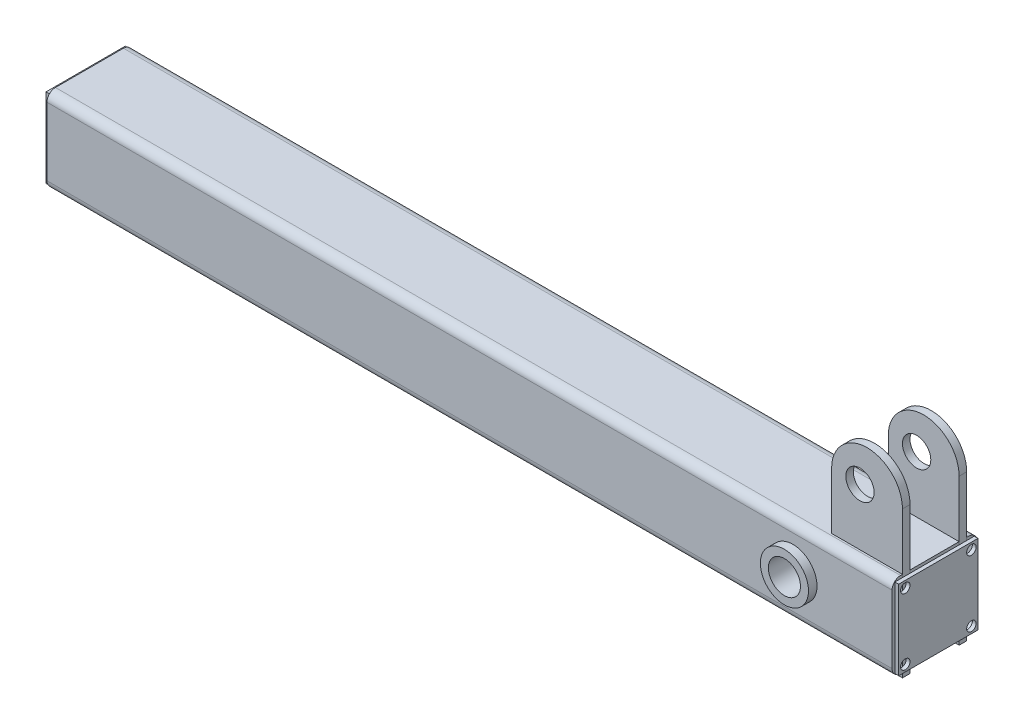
ISO-10303-21;
HEADER;
FILE_DESCRIPTION(('STEP AP214'),'2;1');
FILE_NAME('part.step','',(''),(''),'','','');
FILE_SCHEMA(('AUTOMOTIVE_DESIGN { 1 0 10303 214 1 1 1 1 }'));
ENDSEC;
DATA;
#1=APPLICATION_CONTEXT('core data for automotive mechanical design processes');
#2=APPLICATION_PROTOCOL_DEFINITION('international standard','automotive_design',2000,#1);
#3=PRODUCT_CONTEXT('',#1,'mechanical');
#4=PRODUCT('Part','Part','',(#3));
#5=PRODUCT_RELATED_PRODUCT_CATEGORY('part','',(#4));
#6=PRODUCT_DEFINITION_FORMATION('','',#4);
#7=PRODUCT_DEFINITION_CONTEXT('part definition',#1,'design');
#8=PRODUCT_DEFINITION('design','',#6,#7);
#9=PRODUCT_DEFINITION_SHAPE('','',#8);
#10=(LENGTH_UNIT() NAMED_UNIT(*) SI_UNIT(.MILLI.,.METRE.));
#11=(NAMED_UNIT(*) PLANE_ANGLE_UNIT() SI_UNIT($,.RADIAN.));
#12=(NAMED_UNIT(*) SI_UNIT($,.STERADIAN.) SOLID_ANGLE_UNIT());
#13=UNCERTAINTY_MEASURE_WITH_UNIT(LENGTH_MEASURE(1.E-05),#10,'distance_accuracy_value','');
#14=(GEOMETRIC_REPRESENTATION_CONTEXT(3) GLOBAL_UNCERTAINTY_ASSIGNED_CONTEXT((#13)) GLOBAL_UNIT_ASSIGNED_CONTEXT((#10,
#11,#12)) REPRESENTATION_CONTEXT('',''));
#15=CARTESIAN_POINT('',(0.,0.,0.));
#16=DIRECTION('',(0.,0.,1.));
#17=DIRECTION('',(1.,0.,0.));
#18=AXIS2_PLACEMENT_3D('',#15,#16,#17);
#19=CARTESIAN_POINT('',(899.,42.,-42.));
#20=DIRECTION('',(0.,0.,1.));
#21=DIRECTION('',(0.,-1.,0.));
#22=AXIS2_PLACEMENT_3D('',#19,#20,#21);
#23=PLANE('',#22);
#24=DIRECTION('',(0.,-1.,0.));
#25=VECTOR('',#24,1.);
#26=CARTESIAN_POINT('',(895.,42.,-42.));
#27=LINE('',#26,#25);
#28=CARTESIAN_POINT('',(895.,42.,-42.));
#29=VERTEX_POINT('',#28);
#30=CARTESIAN_POINT('',(895.,-42.,-42.));
#31=VERTEX_POINT('',#30);
#32=EDGE_CURVE('E146',#29,#31,#27,.T.);
#33=ORIENTED_EDGE('',*,*,#32,.F.);
#34=DIRECTION('',(-1.,0.,0.));
#35=VECTOR('',#34,1.);
#36=CARTESIAN_POINT('',(899.,42.,-42.));
#37=LINE('',#36,#35);
#38=CARTESIAN_POINT('',(899.,42.,-42.));
#39=VERTEX_POINT('',#38);
#40=EDGE_CURVE('E145',#39,#29,#37,.T.);
#41=ORIENTED_EDGE('',*,*,#40,.F.);
#42=DIRECTION('',(0.,-1.,0.));
#43=VECTOR('',#42,1.);
#44=CARTESIAN_POINT('',(899.,42.,-42.));
#45=LINE('',#44,#43);
#46=CARTESIAN_POINT('',(899.,-42.,-42.));
#47=VERTEX_POINT('',#46);
#48=EDGE_CURVE('E139',#39,#47,#45,.T.);
#49=ORIENTED_EDGE('',*,*,#48,.T.);
#50=DIRECTION('',(-1.,0.,0.));
#51=VECTOR('',#50,1.);
#52=CARTESIAN_POINT('',(899.,-42.,-42.));
#53=LINE('',#52,#51);
#54=EDGE_CURVE('E13',#47,#31,#53,.T.);
#55=ORIENTED_EDGE('',*,*,#54,.T.);
#56=EDGE_LOOP('',(#33,#41,#49,#55));
#57=FACE_BOUND('',#56,.T.);
#58=ADVANCED_FACE('F82',(#57),#23,.F.);
#59=CARTESIAN_POINT('',(899.,-42.,-42.));
#60=DIRECTION('',(0.,1.,0.));
#61=DIRECTION('',(0.,0.,1.));
#62=AXIS2_PLACEMENT_3D('',#59,#60,#61);
#63=PLANE('',#62);
#64=DIRECTION('',(0.,0.,1.));
#65=VECTOR('',#64,1.);
#66=CARTESIAN_POINT('',(895.,-42.,-42.));
#67=LINE('',#66,#65);
#68=CARTESIAN_POINT('',(895.,-42.,42.));
#69=VERTEX_POINT('',#68);
#70=EDGE_CURVE('E148',#31,#69,#67,.T.);
#71=ORIENTED_EDGE('',*,*,#70,.F.);
#72=ORIENTED_EDGE('',*,*,#54,.F.);
#73=DIRECTION('',(0.,0.,1.));
#74=VECTOR('',#73,1.);
#75=CARTESIAN_POINT('',(899.,-42.,-42.));
#76=LINE('',#75,#74);
#77=CARTESIAN_POINT('',(899.,-42.,42.));
#78=VERTEX_POINT('',#77);
#79=EDGE_CURVE('E123',#47,#78,#76,.T.);
#80=ORIENTED_EDGE('',*,*,#79,.T.);
#81=DIRECTION('',(-1.,0.,0.));
#82=VECTOR('',#81,1.);
#83=CARTESIAN_POINT('',(899.,-42.,42.));
#84=LINE('',#83,#82);
#85=EDGE_CURVE('E90',#78,#69,#84,.T.);
#86=ORIENTED_EDGE('',*,*,#85,.T.);
#87=EDGE_LOOP('',(#71,#72,#80,#86));
#88=FACE_BOUND('',#87,.T.);
#89=ADVANCED_FACE('F137',(#88),#63,.F.);
#90=CARTESIAN_POINT('',(899.,42.,42.));
#91=DIRECTION('',(0.,0.,-1.));
#92=DIRECTION('',(0.,1.,0.));
#93=AXIS2_PLACEMENT_3D('',#90,#91,#92);
#94=PLANE('',#93);
#95=DIRECTION('',(0.,1.,0.));
#96=VECTOR('',#95,1.);
#97=CARTESIAN_POINT('',(895.,42.,42.));
#98=LINE('',#97,#96);
#99=CARTESIAN_POINT('',(895.,42.,42.));
#100=VERTEX_POINT('',#99);
#101=EDGE_CURVE('E133',#69,#100,#98,.T.);
#102=ORIENTED_EDGE('',*,*,#101,.F.);
#103=ORIENTED_EDGE('',*,*,#85,.F.);
#104=DIRECTION('',(0.,1.,0.));
#105=VECTOR('',#104,1.);
#106=CARTESIAN_POINT('',(899.,42.,42.));
#107=LINE('',#106,#105);
#108=CARTESIAN_POINT('',(899.,42.,42.));
#109=VERTEX_POINT('',#108);
#110=EDGE_CURVE('E126',#78,#109,#107,.T.);
#111=ORIENTED_EDGE('',*,*,#110,.T.);
#112=DIRECTION('',(-1.,0.,0.));
#113=VECTOR('',#112,1.);
#114=CARTESIAN_POINT('',(899.,42.,42.));
#115=LINE('',#114,#113);
#116=EDGE_CURVE('E136',#109,#100,#115,.T.);
#117=ORIENTED_EDGE('',*,*,#116,.T.);
#118=EDGE_LOOP('',(#102,#103,#111,#117));
#119=FACE_BOUND('',#118,.T.);
#120=ADVANCED_FACE('F132',(#119),#94,.F.);
#121=CARTESIAN_POINT('',(899.,42.,-42.));
#122=DIRECTION('',(0.,-1.,0.));
#123=DIRECTION('',(0.,0.,-1.));
#124=AXIS2_PLACEMENT_3D('',#121,#122,#123);
#125=PLANE('',#124);
#126=DIRECTION('',(0.,0.,-1.));
#127=VECTOR('',#126,1.);
#128=CARTESIAN_POINT('',(895.,42.,-42.));
#129=LINE('',#128,#127);
#130=EDGE_CURVE('E112',#100,#29,#129,.T.);
#131=ORIENTED_EDGE('',*,*,#130,.F.);
#132=ORIENTED_EDGE('',*,*,#116,.F.);
#133=DIRECTION('',(0.,0.,-1.));
#134=VECTOR('',#133,1.);
#135=CARTESIAN_POINT('',(899.,42.,-42.));
#136=LINE('',#135,#134);
#137=EDGE_CURVE('E98',#109,#39,#136,.T.);
#138=ORIENTED_EDGE('',*,*,#137,.T.);
#139=ORIENTED_EDGE('',*,*,#40,.T.);
#140=EDGE_LOOP('',(#131,#132,#138,#139));
#141=FACE_BOUND('',#140,.T.);
#142=ADVANCED_FACE('F158',(#141),#125,.F.);
#143=CARTESIAN_POINT('',(899.,-42.,-42.));
#144=DIRECTION('',(1.,0.,0.));
#145=DIRECTION('',(0.,0.,1.));
#146=AXIS2_PLACEMENT_3D('',#143,#144,#145);
#147=PLANE('',#146);
#148=CARTESIAN_POINT('',(899.,35.,35.));
#149=DIRECTION('',(-1.,0.,0.));
#150=DIRECTION('',(0.,0.,1.));
#151=AXIS2_PLACEMENT_3D('',#148,#149,#150);
#152=CIRCLE('',#151,5.);
#153=CARTESIAN_POINT('',(899.,35.,40.));
#154=VERTEX_POINT('',#153);
#155=EDGE_CURVE('E298',#154,#154,#152,.T.);
#156=ORIENTED_EDGE('',*,*,#155,.T.);
#157=EDGE_LOOP('',(#156));
#158=FACE_BOUND('',#157,.T.);
#159=CARTESIAN_POINT('',(899.,35.,-35.));
#160=DIRECTION('',(-1.,0.,0.));
#161=DIRECTION('',(0.,0.,1.));
#162=AXIS2_PLACEMENT_3D('',#159,#160,#161);
#163=CIRCLE('',#162,5.);
#164=CARTESIAN_POINT('',(899.,35.,-30.));
#165=VERTEX_POINT('',#164);
#166=EDGE_CURVE('E300',#165,#165,#163,.T.);
#167=ORIENTED_EDGE('',*,*,#166,.T.);
#168=EDGE_LOOP('',(#167));
#169=FACE_BOUND('',#168,.T.);
#170=CARTESIAN_POINT('',(899.,-35.,-35.));
#171=DIRECTION('',(-1.,0.,0.));
#172=DIRECTION('',(0.,0.,1.));
#173=AXIS2_PLACEMENT_3D('',#170,#171,#172);
#174=CIRCLE('',#173,5.);
#175=CARTESIAN_POINT('',(899.,-35.,-30.));
#176=VERTEX_POINT('',#175);
#177=EDGE_CURVE('E308',#176,#176,#174,.T.);
#178=ORIENTED_EDGE('',*,*,#177,.T.);
#179=EDGE_LOOP('',(#178));
#180=FACE_BOUND('',#179,.T.);
#181=CARTESIAN_POINT('',(899.,-35.,35.));
#182=DIRECTION('',(-1.,0.,0.));
#183=DIRECTION('',(0.,0.,1.));
#184=AXIS2_PLACEMENT_3D('',#181,#182,#183);
#185=CIRCLE('',#184,5.);
#186=CARTESIAN_POINT('',(899.,-35.,40.));
#187=VERTEX_POINT('',#186);
#188=EDGE_CURVE('E314',#187,#187,#185,.T.);
#189=ORIENTED_EDGE('',*,*,#188,.T.);
#190=EDGE_LOOP('',(#189));
#191=FACE_BOUND('',#190,.T.);
#192=ORIENTED_EDGE('',*,*,#48,.F.);
#193=ORIENTED_EDGE('',*,*,#137,.F.);
#194=ORIENTED_EDGE('',*,*,#110,.F.);
#195=ORIENTED_EDGE('',*,*,#79,.F.);
#196=EDGE_LOOP('',(#192,#193,#194,#195));
#197=FACE_BOUND('',#196,.T.);
#198=ADVANCED_FACE('F128',(#158,#169,#180,#191,#197),#147,.T.);
#199=CARTESIAN_POINT('',(895.,-42.,-42.));
#200=DIRECTION('',(1.,0.,0.));
#201=DIRECTION('',(0.,0.,1.));
#202=AXIS2_PLACEMENT_3D('',#199,#200,#201);
#203=PLANE('',#202);
#204=CARTESIAN_POINT('',(895.,35.,35.));
#205=DIRECTION('',(-1.,0.,0.));
#206=DIRECTION('',(0.,0.,1.));
#207=AXIS2_PLACEMENT_3D('',#204,#205,#206);
#208=CIRCLE('',#207,5.);
#209=CARTESIAN_POINT('',(895.,35.,40.));
#210=VERTEX_POINT('',#209);
#211=EDGE_CURVE('E295',#210,#210,#208,.T.);
#212=ORIENTED_EDGE('',*,*,#211,.F.);
#213=EDGE_LOOP('',(#212));
#214=FACE_BOUND('',#213,.T.);
#215=CARTESIAN_POINT('',(895.,35.,-35.));
#216=DIRECTION('',(-1.,0.,0.));
#217=DIRECTION('',(0.,0.,1.));
#218=AXIS2_PLACEMENT_3D('',#215,#216,#217);
#219=CIRCLE('',#218,5.);
#220=CARTESIAN_POINT('',(895.,35.,-30.));
#221=VERTEX_POINT('',#220);
#222=EDGE_CURVE('E305',#221,#221,#219,.T.);
#223=ORIENTED_EDGE('',*,*,#222,.F.);
#224=EDGE_LOOP('',(#223));
#225=FACE_BOUND('',#224,.T.);
#226=CARTESIAN_POINT('',(895.,-35.,-35.));
#227=DIRECTION('',(-1.,0.,0.));
#228=DIRECTION('',(0.,0.,1.));
#229=AXIS2_PLACEMENT_3D('',#226,#227,#228);
#230=CIRCLE('',#229,5.);
#231=CARTESIAN_POINT('',(895.,-35.,-30.));
#232=VERTEX_POINT('',#231);
#233=EDGE_CURVE('E311',#232,#232,#230,.T.);
#234=ORIENTED_EDGE('',*,*,#233,.F.);
#235=EDGE_LOOP('',(#234));
#236=FACE_BOUND('',#235,.T.);
#237=CARTESIAN_POINT('',(895.,-35.,35.));
#238=DIRECTION('',(-1.,0.,0.));
#239=DIRECTION('',(0.,0.,1.));
#240=AXIS2_PLACEMENT_3D('',#237,#238,#239);
#241=CIRCLE('',#240,5.);
#242=CARTESIAN_POINT('',(895.,-35.,40.));
#243=VERTEX_POINT('',#242);
#244=EDGE_CURVE('E149',#243,#243,#241,.T.);
#245=ORIENTED_EDGE('',*,*,#244,.F.);
#246=EDGE_LOOP('',(#245));
#247=FACE_BOUND('',#246,.T.);
#248=ORIENTED_EDGE('',*,*,#32,.T.);
#249=ORIENTED_EDGE('',*,*,#70,.T.);
#250=ORIENTED_EDGE('',*,*,#101,.T.);
#251=ORIENTED_EDGE('',*,*,#130,.T.);
#252=EDGE_LOOP('',(#248,#249,#250,#251));
#253=FACE_BOUND('',#252,.T.);
#254=ADVANCED_FACE('F154',(#214,#225,#236,#247,#253),#203,.F.);
#255=CARTESIAN_POINT('',(899.,-35.,35.));
#256=DIRECTION('',(1.,0.,0.));
#257=DIRECTION('',(0.,0.,1.));
#258=AXIS2_PLACEMENT_3D('',#255,#256,#257);
#259=CYLINDRICAL_SURFACE('',#258,5.);
#260=ORIENTED_EDGE('',*,*,#244,.T.);
#261=EDGE_LOOP('',(#260));
#262=FACE_BOUND('',#261,.T.);
#263=ORIENTED_EDGE('',*,*,#188,.F.);
#264=EDGE_LOOP('',(#263));
#265=FACE_BOUND('',#264,.T.);
#266=ADVANCED_FACE('F198',(#262,#265),#259,.F.);
#267=CARTESIAN_POINT('',(899.,-35.,-35.));
#268=DIRECTION('',(1.,0.,0.));
#269=DIRECTION('',(0.,0.,1.));
#270=AXIS2_PLACEMENT_3D('',#267,#268,#269);
#271=CYLINDRICAL_SURFACE('',#270,5.);
#272=ORIENTED_EDGE('',*,*,#233,.T.);
#273=EDGE_LOOP('',(#272));
#274=FACE_BOUND('',#273,.T.);
#275=ORIENTED_EDGE('',*,*,#177,.F.);
#276=EDGE_LOOP('',(#275));
#277=FACE_BOUND('',#276,.T.);
#278=ADVANCED_FACE('F207',(#274,#277),#271,.F.);
#279=CARTESIAN_POINT('',(899.,35.,-35.));
#280=DIRECTION('',(1.,0.,0.));
#281=DIRECTION('',(0.,0.,1.));
#282=AXIS2_PLACEMENT_3D('',#279,#280,#281);
#283=CYLINDRICAL_SURFACE('',#282,5.);
#284=ORIENTED_EDGE('',*,*,#222,.T.);
#285=EDGE_LOOP('',(#284));
#286=FACE_BOUND('',#285,.T.);
#287=ORIENTED_EDGE('',*,*,#166,.F.);
#288=EDGE_LOOP('',(#287));
#289=FACE_BOUND('',#288,.T.);
#290=ADVANCED_FACE('F217',(#286,#289),#283,.F.);
#291=CARTESIAN_POINT('',(899.,35.,35.));
#292=DIRECTION('',(1.,0.,0.));
#293=DIRECTION('',(0.,0.,1.));
#294=AXIS2_PLACEMENT_3D('',#291,#292,#293);
#295=CYLINDRICAL_SURFACE('',#294,5.);
#296=ORIENTED_EDGE('',*,*,#211,.T.);
#297=EDGE_LOOP('',(#296));
#298=FACE_BOUND('',#297,.T.);
#299=ORIENTED_EDGE('',*,*,#155,.F.);
#300=EDGE_LOOP('',(#299));
#301=FACE_BOUND('',#300,.T.);
#302=ADVANCED_FACE('F227',(#298,#301),#295,.F.);
#303=CLOSED_SHELL('',(#58,#89,#120,#142,#198,#254,#266,#278,#290,#302));
#304=MANIFOLD_SOLID_BREP('B2',#303);
#305=CARTESIAN_POINT('',(-4.,42.,-42.));
#306=DIRECTION('',(0.,0.,1.));
#307=DIRECTION('',(0.,-1.,0.));
#308=AXIS2_PLACEMENT_3D('',#305,#306,#307);
#309=PLANE('',#308);
#310=DIRECTION('',(0.,-1.,0.));
#311=VECTOR('',#310,1.);
#312=CARTESIAN_POINT('',(0.,42.,-42.));
#313=LINE('',#312,#311);
#314=CARTESIAN_POINT('',(0.,42.,-42.));
#315=VERTEX_POINT('',#314);
#316=CARTESIAN_POINT('',(0.,-42.,-42.));
#317=VERTEX_POINT('',#316);
#318=EDGE_CURVE('E405',#315,#317,#313,.T.);
#319=ORIENTED_EDGE('',*,*,#318,.T.);
#320=DIRECTION('',(1.,0.,0.));
#321=VECTOR('',#320,1.);
#322=CARTESIAN_POINT('',(-4.,-42.,-42.));
#323=LINE('',#322,#321);
#324=CARTESIAN_POINT('',(-4.,-42.,-42.));
#325=VERTEX_POINT('',#324);
#326=EDGE_CURVE('E80',#325,#317,#323,.T.);
#327=ORIENTED_EDGE('',*,*,#326,.F.);
#328=DIRECTION('',(0.,-1.,0.));
#329=VECTOR('',#328,1.);
#330=CARTESIAN_POINT('',(-4.,42.,-42.));
#331=LINE('',#330,#329);
#332=CARTESIAN_POINT('',(-4.,42.,-42.));
#333=VERTEX_POINT('',#332);
#334=EDGE_CURVE('E393',#333,#325,#331,.T.);
#335=ORIENTED_EDGE('',*,*,#334,.F.);
#336=DIRECTION('',(1.,0.,0.));
#337=VECTOR('',#336,1.);
#338=CARTESIAN_POINT('',(-4.,42.,-42.));
#339=LINE('',#338,#337);
#340=EDGE_CURVE('E401',#333,#315,#339,.T.);
#341=ORIENTED_EDGE('',*,*,#340,.T.);
#342=EDGE_LOOP('',(#319,#327,#335,#341));
#343=FACE_BOUND('',#342,.T.);
#344=ADVANCED_FACE('F342',(#343),#309,.F.);
#345=CARTESIAN_POINT('',(-4.,-42.,-42.));
#346=DIRECTION('',(0.,1.,0.));
#347=DIRECTION('',(0.,0.,1.));
#348=AXIS2_PLACEMENT_3D('',#345,#346,#347);
#349=PLANE('',#348);
#350=DIRECTION('',(0.,0.,1.));
#351=VECTOR('',#350,1.);
#352=CARTESIAN_POINT('',(0.,-42.,-42.));
#353=LINE('',#352,#351);
#354=CARTESIAN_POINT('',(0.,-42.,42.));
#355=VERTEX_POINT('',#354);
#356=EDGE_CURVE('E397',#317,#355,#353,.T.);
#357=ORIENTED_EDGE('',*,*,#356,.T.);
#358=DIRECTION('',(1.,0.,0.));
#359=VECTOR('',#358,1.);
#360=CARTESIAN_POINT('',(-4.,-42.,42.));
#361=LINE('',#360,#359);
#362=CARTESIAN_POINT('',(-4.,-42.,42.));
#363=VERTEX_POINT('',#362);
#364=EDGE_CURVE('E350',#363,#355,#361,.T.);
#365=ORIENTED_EDGE('',*,*,#364,.F.);
#366=DIRECTION('',(0.,0.,1.));
#367=VECTOR('',#366,1.);
#368=CARTESIAN_POINT('',(-4.,-42.,-42.));
#369=LINE('',#368,#367);
#370=EDGE_CURVE('E388',#325,#363,#369,.T.);
#371=ORIENTED_EDGE('',*,*,#370,.F.);
#372=ORIENTED_EDGE('',*,*,#326,.T.);
#373=EDGE_LOOP('',(#357,#365,#371,#372));
#374=FACE_BOUND('',#373,.T.);
#375=ADVANCED_FACE('F396',(#374),#349,.F.);
#376=CARTESIAN_POINT('',(-4.,42.,42.));
#377=DIRECTION('',(0.,0.,-1.));
#378=DIRECTION('',(0.,1.,0.));
#379=AXIS2_PLACEMENT_3D('',#376,#377,#378);
#380=PLANE('',#379);
#381=DIRECTION('',(0.,1.,0.));
#382=VECTOR('',#381,1.);
#383=CARTESIAN_POINT('',(0.,42.,42.));
#384=LINE('',#383,#382);
#385=CARTESIAN_POINT('',(0.,42.,42.));
#386=VERTEX_POINT('',#385);
#387=EDGE_CURVE('E375',#355,#386,#384,.T.);
#388=ORIENTED_EDGE('',*,*,#387,.T.);
#389=DIRECTION('',(1.,0.,0.));
#390=VECTOR('',#389,1.);
#391=CARTESIAN_POINT('',(-4.,42.,42.));
#392=LINE('',#391,#390);
#393=CARTESIAN_POINT('',(-4.,42.,42.));
#394=VERTEX_POINT('',#393);
#395=EDGE_CURVE('E398',#394,#386,#392,.T.);
#396=ORIENTED_EDGE('',*,*,#395,.F.);
#397=DIRECTION('',(0.,1.,0.));
#398=VECTOR('',#397,1.);
#399=CARTESIAN_POINT('',(-4.,42.,42.));
#400=LINE('',#399,#398);
#401=EDGE_CURVE('E391',#363,#394,#400,.T.);
#402=ORIENTED_EDGE('',*,*,#401,.F.);
#403=ORIENTED_EDGE('',*,*,#364,.T.);
#404=EDGE_LOOP('',(#388,#396,#402,#403));
#405=FACE_BOUND('',#404,.T.);
#406=ADVANCED_FACE('F399',(#405),#380,.F.);
#407=CARTESIAN_POINT('',(-4.,42.,-42.));
#408=DIRECTION('',(0.,-1.,0.));
#409=DIRECTION('',(0.,0.,-1.));
#410=AXIS2_PLACEMENT_3D('',#407,#408,#409);
#411=PLANE('',#410);
#412=DIRECTION('',(0.,0.,-1.));
#413=VECTOR('',#412,1.);
#414=CARTESIAN_POINT('',(0.,42.,-42.));
#415=LINE('',#414,#413);
#416=EDGE_CURVE('E381',#386,#315,#415,.T.);
#417=ORIENTED_EDGE('',*,*,#416,.T.);
#418=ORIENTED_EDGE('',*,*,#340,.F.);
#419=DIRECTION('',(0.,0.,-1.));
#420=VECTOR('',#419,1.);
#421=CARTESIAN_POINT('',(-4.,42.,-42.));
#422=LINE('',#421,#420);
#423=EDGE_CURVE('E358',#394,#333,#422,.T.);
#424=ORIENTED_EDGE('',*,*,#423,.F.);
#425=ORIENTED_EDGE('',*,*,#395,.T.);
#426=EDGE_LOOP('',(#417,#418,#424,#425));
#427=FACE_BOUND('',#426,.T.);
#428=ADVANCED_FACE('F413',(#427),#411,.F.);
#429=CARTESIAN_POINT('',(-4.,-42.,-42.));
#430=DIRECTION('',(-1.,0.,0.));
#431=DIRECTION('',(0.,0.,1.));
#432=AXIS2_PLACEMENT_3D('',#429,#430,#431);
#433=PLANE('',#432);
#434=CARTESIAN_POINT('',(-4.,35.,35.));
#435=DIRECTION('',(-1.,0.,0.));
#436=DIRECTION('',(0.,0.,1.));
#437=AXIS2_PLACEMENT_3D('',#434,#435,#436);
#438=CIRCLE('',#437,5.);
#439=CARTESIAN_POINT('',(-4.,35.,40.));
#440=VERTEX_POINT('',#439);
#441=EDGE_CURVE('E439',#440,#440,#438,.T.);
#442=ORIENTED_EDGE('',*,*,#441,.F.);
#443=EDGE_LOOP('',(#442));
#444=FACE_BOUND('',#443,.T.);
#445=CARTESIAN_POINT('',(-4.,35.,-35.));
#446=DIRECTION('',(-1.,0.,0.));
#447=DIRECTION('',(0.,0.,1.));
#448=AXIS2_PLACEMENT_3D('',#445,#446,#447);
#449=CIRCLE('',#448,5.);
#450=CARTESIAN_POINT('',(-4.,35.,-30.));
#451=VERTEX_POINT('',#450);
#452=EDGE_CURVE('E433',#451,#451,#449,.T.);
#453=ORIENTED_EDGE('',*,*,#452,.F.);
#454=EDGE_LOOP('',(#453));
#455=FACE_BOUND('',#454,.T.);
#456=CARTESIAN_POINT('',(-4.,-35.,-35.));
#457=DIRECTION('',(-1.,0.,0.));
#458=DIRECTION('',(0.,0.,1.));
#459=AXIS2_PLACEMENT_3D('',#456,#457,#458);
#460=CIRCLE('',#459,5.);
#461=CARTESIAN_POINT('',(-4.,-35.,-30.));
#462=VERTEX_POINT('',#461);
#463=EDGE_CURVE('E427',#462,#462,#460,.T.);
#464=ORIENTED_EDGE('',*,*,#463,.F.);
#465=EDGE_LOOP('',(#464));
#466=FACE_BOUND('',#465,.T.);
#467=CARTESIAN_POINT('',(-4.,-35.,35.));
#468=DIRECTION('',(-1.,0.,0.));
#469=DIRECTION('',(0.,0.,1.));
#470=AXIS2_PLACEMENT_3D('',#467,#468,#469);
#471=CIRCLE('',#470,5.);
#472=CARTESIAN_POINT('',(-4.,-35.,40.));
#473=VERTEX_POINT('',#472);
#474=EDGE_CURVE('E421',#473,#473,#471,.T.);
#475=ORIENTED_EDGE('',*,*,#474,.F.);
#476=EDGE_LOOP('',(#475));
#477=FACE_BOUND('',#476,.T.);
#478=ORIENTED_EDGE('',*,*,#334,.T.);
#479=ORIENTED_EDGE('',*,*,#370,.T.);
#480=ORIENTED_EDGE('',*,*,#401,.T.);
#481=ORIENTED_EDGE('',*,*,#423,.T.);
#482=EDGE_LOOP('',(#478,#479,#480,#481));
#483=FACE_BOUND('',#482,.T.);
#484=ADVANCED_FACE('F389',(#444,#455,#466,#477,#483),#433,.T.);
#485=CARTESIAN_POINT('',(0.,-42.,-42.));
#486=DIRECTION('',(-1.,0.,0.));
#487=DIRECTION('',(0.,0.,1.));
#488=AXIS2_PLACEMENT_3D('',#485,#486,#487);
#489=PLANE('',#488);
#490=CARTESIAN_POINT('',(0.,35.,35.));
#491=DIRECTION('',(-1.,0.,0.));
#492=DIRECTION('',(0.,0.,1.));
#493=AXIS2_PLACEMENT_3D('',#490,#491,#492);
#494=CIRCLE('',#493,5.);
#495=CARTESIAN_POINT('',(0.,35.,40.));
#496=VERTEX_POINT('',#495);
#497=EDGE_CURVE('E436',#496,#496,#494,.T.);
#498=ORIENTED_EDGE('',*,*,#497,.T.);
#499=EDGE_LOOP('',(#498));
#500=FACE_BOUND('',#499,.T.);
#501=CARTESIAN_POINT('',(0.,35.,-35.));
#502=DIRECTION('',(-1.,0.,0.));
#503=DIRECTION('',(0.,0.,1.));
#504=AXIS2_PLACEMENT_3D('',#501,#502,#503);
#505=CIRCLE('',#504,5.);
#506=CARTESIAN_POINT('',(0.,35.,-30.));
#507=VERTEX_POINT('',#506);
#508=EDGE_CURVE('E430',#507,#507,#505,.T.);
#509=ORIENTED_EDGE('',*,*,#508,.T.);
#510=EDGE_LOOP('',(#509));
#511=FACE_BOUND('',#510,.T.);
#512=CARTESIAN_POINT('',(0.,-35.,-35.));
#513=DIRECTION('',(-1.,0.,0.));
#514=DIRECTION('',(0.,0.,1.));
#515=AXIS2_PLACEMENT_3D('',#512,#513,#514);
#516=CIRCLE('',#515,5.);
#517=CARTESIAN_POINT('',(0.,-35.,-30.));
#518=VERTEX_POINT('',#517);
#519=EDGE_CURVE('E424',#518,#518,#516,.T.);
#520=ORIENTED_EDGE('',*,*,#519,.T.);
#521=EDGE_LOOP('',(#520));
#522=FACE_BOUND('',#521,.T.);
#523=CARTESIAN_POINT('',(0.,-35.,35.));
#524=DIRECTION('',(-1.,0.,0.));
#525=DIRECTION('',(0.,0.,1.));
#526=AXIS2_PLACEMENT_3D('',#523,#524,#525);
#527=CIRCLE('',#526,5.);
#528=CARTESIAN_POINT('',(0.,-35.,40.));
#529=VERTEX_POINT('',#528);
#530=EDGE_CURVE('E408',#529,#529,#527,.T.);
#531=ORIENTED_EDGE('',*,*,#530,.T.);
#532=EDGE_LOOP('',(#531));
#533=FACE_BOUND('',#532,.T.);
#534=ORIENTED_EDGE('',*,*,#318,.F.);
#535=ORIENTED_EDGE('',*,*,#416,.F.);
#536=ORIENTED_EDGE('',*,*,#387,.F.);
#537=ORIENTED_EDGE('',*,*,#356,.F.);
#538=EDGE_LOOP('',(#534,#535,#536,#537));
#539=FACE_BOUND('',#538,.T.);
#540=ADVANCED_FACE('F416',(#500,#511,#522,#533,#539),#489,.F.);
#541=CARTESIAN_POINT('',(-4.,-35.,35.));
#542=DIRECTION('',(-1.,0.,0.));
#543=DIRECTION('',(0.,0.,1.));
#544=AXIS2_PLACEMENT_3D('',#541,#542,#543);
#545=CYLINDRICAL_SURFACE('',#544,5.);
#546=ORIENTED_EDGE('',*,*,#530,.F.);
#547=EDGE_LOOP('',(#546));
#548=FACE_BOUND('',#547,.T.);
#549=ORIENTED_EDGE('',*,*,#474,.T.);
#550=EDGE_LOOP('',(#549));
#551=FACE_BOUND('',#550,.T.);
#552=ADVANCED_FACE('F454',(#548,#551),#545,.F.);
#553=CARTESIAN_POINT('',(-4.,-35.,-35.));
#554=DIRECTION('',(-1.,0.,0.));
#555=DIRECTION('',(0.,0.,1.));
#556=AXIS2_PLACEMENT_3D('',#553,#554,#555);
#557=CYLINDRICAL_SURFACE('',#556,5.);
#558=ORIENTED_EDGE('',*,*,#519,.F.);
#559=EDGE_LOOP('',(#558));
#560=FACE_BOUND('',#559,.T.);
#561=ORIENTED_EDGE('',*,*,#463,.T.);
#562=EDGE_LOOP('',(#561));
#563=FACE_BOUND('',#562,.T.);
#564=ADVANCED_FACE('F456',(#560,#563),#557,.F.);
#565=CARTESIAN_POINT('',(-4.,35.,-35.));
#566=DIRECTION('',(-1.,0.,0.));
#567=DIRECTION('',(0.,0.,1.));
#568=AXIS2_PLACEMENT_3D('',#565,#566,#567);
#569=CYLINDRICAL_SURFACE('',#568,5.);
#570=ORIENTED_EDGE('',*,*,#508,.F.);
#571=EDGE_LOOP('',(#570));
#572=FACE_BOUND('',#571,.T.);
#573=ORIENTED_EDGE('',*,*,#452,.T.);
#574=EDGE_LOOP('',(#573));
#575=FACE_BOUND('',#574,.T.);
#576=ADVANCED_FACE('F463',(#572,#575),#569,.F.);
#577=CARTESIAN_POINT('',(-4.,35.,35.));
#578=DIRECTION('',(-1.,0.,0.));
#579=DIRECTION('',(0.,0.,1.));
#580=AXIS2_PLACEMENT_3D('',#577,#578,#579);
#581=CYLINDRICAL_SURFACE('',#580,5.);
#582=ORIENTED_EDGE('',*,*,#497,.F.);
#583=EDGE_LOOP('',(#582));
#584=FACE_BOUND('',#583,.T.);
#585=ORIENTED_EDGE('',*,*,#441,.T.);
#586=EDGE_LOOP('',(#585));
#587=FACE_BOUND('',#586,.T.);
#588=ADVANCED_FACE('F443',(#584,#587),#581,.F.);
#589=CLOSED_SHELL('',(#344,#375,#406,#428,#484,#540,#552,#564,#576,#588));
#590=MANIFOLD_SOLID_BREP('B7',#589);
#591=CARTESIAN_POINT('',(790.,0.,-54.));
#592=DIRECTION('',(0.,0.,1.));
#593=DIRECTION('',(1.,0.,0.));
#594=AXIS2_PLACEMENT_3D('',#591,#592,#593);
#595=CYLINDRICAL_SURFACE('',#594,13.4999999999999);
#596=CARTESIAN_POINT('',(790.,0.,-21.8969878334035));
#597=DIRECTION('',(0.,0.,-1.));
#598=DIRECTION('',(-1.,0.,0.));
#599=AXIS2_PLACEMENT_3D('',#596,#597,#598);
#600=CIRCLE('',#599,13.4999999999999);
#601=CARTESIAN_POINT('',(776.5,0.,-21.8969878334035));
#602=VERTEX_POINT('',#601);
#603=EDGE_CURVE('E574',#602,#602,#600,.F.);
#604=ORIENTED_EDGE('',*,*,#603,.F.);
#605=EDGE_LOOP('',(#604));
#606=FACE_BOUND('',#605,.T.);
#607=CARTESIAN_POINT('',(790.,0.,21.8969878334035));
#608=DIRECTION('',(0.,0.,1.));
#609=DIRECTION('',(1.,0.,0.));
#610=AXIS2_PLACEMENT_3D('',#607,#608,#609);
#611=CIRCLE('',#610,13.4999999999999);
#612=CARTESIAN_POINT('',(803.5,0.,21.8969878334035));
#613=VERTEX_POINT('',#612);
#614=EDGE_CURVE('E583',#613,#613,#611,.F.);
#615=ORIENTED_EDGE('',*,*,#614,.F.);
#616=EDGE_LOOP('',(#615));
#617=FACE_BOUND('',#616,.T.);
#618=ADVANCED_FACE('F571',(#606,#617),#595,.F.);
#619=CARTESIAN_POINT('',(790.,0.,-54.));
#620=DIRECTION('',(0.,0.,1.));
#621=DIRECTION('',(1.,0.,0.));
#622=AXIS2_PLACEMENT_3D('',#619,#620,#621);
#623=CYLINDRICAL_SURFACE('',#622,25.5);
#624=CARTESIAN_POINT('',(790.,0.,-54.));
#625=DIRECTION('',(0.,0.,-1.));
#626=DIRECTION('',(-1.,0.,0.));
#627=AXIS2_PLACEMENT_3D('',#624,#625,#626);
#628=CIRCLE('',#627,25.5);
#629=CARTESIAN_POINT('',(764.5,0.,-54.));
#630=VERTEX_POINT('',#629);
#631=EDGE_CURVE('E341',#630,#630,#628,.T.);
#632=ORIENTED_EDGE('',*,*,#631,.F.);
#633=EDGE_LOOP('',(#632));
#634=FACE_BOUND('',#633,.T.);
#635=CARTESIAN_POINT('',(790.,0.,54.));
#636=DIRECTION('',(0.,0.,-1.));
#637=DIRECTION('',(-1.,0.,0.));
#638=AXIS2_PLACEMENT_3D('',#635,#636,#637);
#639=CIRCLE('',#638,25.5);
#640=CARTESIAN_POINT('',(764.5,0.,54.));
#641=VERTEX_POINT('',#640);
#642=EDGE_CURVE('E578',#641,#641,#639,.T.);
#643=ORIENTED_EDGE('',*,*,#642,.T.);
#644=EDGE_LOOP('',(#643));
#645=FACE_BOUND('',#644,.T.);
#646=ADVANCED_FACE('F612',(#634,#645),#623,.T.);
#647=CARTESIAN_POINT('',(790.,0.,-54.));
#648=DIRECTION('',(0.,0.,-1.));
#649=DIRECTION('',(-1.,0.,0.));
#650=AXIS2_PLACEMENT_3D('',#647,#648,#649);
#651=PLANE('',#650);
#652=CARTESIAN_POINT('',(790.,0.,-54.));
#653=DIRECTION('',(0.,0.,-1.));
#654=DIRECTION('',(-1.,0.,0.));
#655=AXIS2_PLACEMENT_3D('',#652,#653,#654);
#656=CIRCLE('',#655,17.);
#657=CARTESIAN_POINT('',(773.,0.,-54.));
#658=VERTEX_POINT('',#657);
#659=EDGE_CURVE('E603',#658,#658,#656,.T.);
#660=ORIENTED_EDGE('',*,*,#659,.F.);
#661=EDGE_LOOP('',(#660));
#662=FACE_BOUND('',#661,.T.);
#663=ORIENTED_EDGE('',*,*,#631,.T.);
#664=EDGE_LOOP('',(#663));
#665=FACE_BOUND('',#664,.T.);
#666=ADVANCED_FACE('F609',(#662,#665),#651,.T.);
#667=CARTESIAN_POINT('',(790.,0.,54.));
#668=DIRECTION('',(0.,0.,-1.));
#669=DIRECTION('',(-1.,0.,0.));
#670=AXIS2_PLACEMENT_3D('',#667,#668,#669);
#671=PLANE('',#670);
#672=CARTESIAN_POINT('',(790.,0.,54.));
#673=DIRECTION('',(0.,0.,1.));
#674=DIRECTION('',(1.,0.,0.));
#675=AXIS2_PLACEMENT_3D('',#672,#673,#674);
#676=CIRCLE('',#675,17.);
#677=CARTESIAN_POINT('',(807.,0.,54.));
#678=VERTEX_POINT('',#677);
#679=EDGE_CURVE('E592',#678,#678,#676,.T.);
#680=ORIENTED_EDGE('',*,*,#679,.F.);
#681=EDGE_LOOP('',(#680));
#682=FACE_BOUND('',#681,.T.);
#683=ORIENTED_EDGE('',*,*,#642,.F.);
#684=EDGE_LOOP('',(#683));
#685=FACE_BOUND('',#684,.T.);
#686=ADVANCED_FACE('F611',(#682,#685),#671,.F.);
#687=CARTESIAN_POINT('',(790.,0.,24.));
#688=DIRECTION('',(0.,0.,1.));
#689=DIRECTION('',(1.,0.,0.));
#690=AXIS2_PLACEMENT_3D('',#687,#688,#689);
#691=CONICAL_SURFACE('',#690,17.,1.02974425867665);
#692=ORIENTED_EDGE('',*,*,#614,.T.);
#693=EDGE_LOOP('',(#692));
#694=FACE_BOUND('',#693,.T.);
#695=CARTESIAN_POINT('',(790.,0.,24.));
#696=DIRECTION('',(0.,0.,1.));
#697=DIRECTION('',(1.,0.,0.));
#698=AXIS2_PLACEMENT_3D('',#695,#696,#697);
#699=CIRCLE('',#698,17.);
#700=CARTESIAN_POINT('',(807.,0.,24.));
#701=VERTEX_POINT('',#700);
#702=EDGE_CURVE('E586',#701,#701,#699,.T.);
#703=ORIENTED_EDGE('',*,*,#702,.T.);
#704=EDGE_LOOP('',(#703));
#705=FACE_BOUND('',#704,.T.);
#706=ADVANCED_FACE('F618',(#694,#705),#691,.F.);
#707=CARTESIAN_POINT('',(790.,0.,54.));
#708=DIRECTION('',(0.,0.,1.));
#709=DIRECTION('',(1.,0.,0.));
#710=AXIS2_PLACEMENT_3D('',#707,#708,#709);
#711=CYLINDRICAL_SURFACE('',#710,17.);
#712=ORIENTED_EDGE('',*,*,#702,.F.);
#713=EDGE_LOOP('',(#712));
#714=FACE_BOUND('',#713,.T.);
#715=ORIENTED_EDGE('',*,*,#679,.T.);
#716=EDGE_LOOP('',(#715));
#717=FACE_BOUND('',#716,.T.);
#718=ADVANCED_FACE('F633',(#714,#717),#711,.F.);
#719=CARTESIAN_POINT('',(790.,0.,-24.));
#720=DIRECTION('',(0.,0.,-1.));
#721=DIRECTION('',(-1.,0.,0.));
#722=AXIS2_PLACEMENT_3D('',#719,#720,#721);
#723=CONICAL_SURFACE('',#722,17.,1.02974425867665);
#724=ORIENTED_EDGE('',*,*,#603,.T.);
#725=EDGE_LOOP('',(#724));
#726=FACE_BOUND('',#725,.T.);
#727=CARTESIAN_POINT('',(790.,0.,-24.));
#728=DIRECTION('',(0.,0.,-1.));
#729=DIRECTION('',(-1.,0.,0.));
#730=AXIS2_PLACEMENT_3D('',#727,#728,#729);
#731=CIRCLE('',#730,17.);
#732=CARTESIAN_POINT('',(773.,0.,-24.));
#733=VERTEX_POINT('',#732);
#734=EDGE_CURVE('E599',#733,#733,#731,.T.);
#735=ORIENTED_EDGE('',*,*,#734,.T.);
#736=EDGE_LOOP('',(#735));
#737=FACE_BOUND('',#736,.T.);
#738=ADVANCED_FACE('F630',(#726,#737),#723,.F.);
#739=CARTESIAN_POINT('',(790.,0.,-54.));
#740=DIRECTION('',(0.,0.,-1.));
#741=DIRECTION('',(-1.,0.,0.));
#742=AXIS2_PLACEMENT_3D('',#739,#740,#741);
#743=CYLINDRICAL_SURFACE('',#742,17.);
#744=ORIENTED_EDGE('',*,*,#734,.F.);
#745=EDGE_LOOP('',(#744));
#746=FACE_BOUND('',#745,.T.);
#747=ORIENTED_EDGE('',*,*,#659,.T.);
#748=EDGE_LOOP('',(#747));
#749=FACE_BOUND('',#748,.T.);
#750=ADVANCED_FACE('F607',(#746,#749),#743,.F.);
#751=CLOSED_SHELL('',(#618,#646,#666,#686,#706,#718,#738,#750));
#752=MANIFOLD_SOLID_BREP('B74',#751);
#753=CARTESIAN_POINT('',(895.,-50.,-26.));
#754=DIRECTION('',(1.,0.,0.));
#755=DIRECTION('',(0.,1.,0.));
#756=AXIS2_PLACEMENT_3D('',#753,#754,#755);
#757=PLANE('',#756);
#758=DIRECTION('',(0.,1.,0.));
#759=VECTOR('',#758,1.);
#760=CARTESIAN_POINT('',(895.,-50.,-34.));
#761=LINE('',#760,#759);
#762=CARTESIAN_POINT('',(895.,-50.,-34.));
#763=VERTEX_POINT('',#762);
#764=CARTESIAN_POINT('',(895.,105.,-34.));
#765=VERTEX_POINT('',#764);
#766=EDGE_CURVE('E805',#763,#765,#761,.T.);
#767=ORIENTED_EDGE('',*,*,#766,.T.);
#768=DIRECTION('',(0.,0.,-1.));
#769=VECTOR('',#768,1.);
#770=CARTESIAN_POINT('',(895.,105.,-26.));
#771=LINE('',#770,#769);
#772=CARTESIAN_POINT('',(895.,105.,-26.));
#773=VERTEX_POINT('',#772);
#774=EDGE_CURVE('E744',#773,#765,#771,.T.);
#775=ORIENTED_EDGE('',*,*,#774,.F.);
#776=DIRECTION('',(0.,1.,0.));
#777=VECTOR('',#776,1.);
#778=CARTESIAN_POINT('',(895.,-50.,-26.));
#779=LINE('',#778,#777);
#780=CARTESIAN_POINT('',(895.,-50.,-26.));
#781=VERTEX_POINT('',#780);
#782=EDGE_CURVE('E794',#781,#773,#779,.T.);
#783=ORIENTED_EDGE('',*,*,#782,.F.);
#784=DIRECTION('',(0.,0.,-1.));
#785=VECTOR('',#784,1.);
#786=CARTESIAN_POINT('',(895.,-50.,-26.));
#787=LINE('',#786,#785);
#788=EDGE_CURVE('E569',#781,#763,#787,.T.);
#789=ORIENTED_EDGE('',*,*,#788,.T.);
#790=EDGE_LOOP('',(#767,#775,#783,#789));
#791=FACE_BOUND('',#790,.T.);
#792=ADVANCED_FACE('F741',(#791),#757,.T.);
#793=CARTESIAN_POINT('',(895.,-50.,-26.));
#794=DIRECTION('',(0.,-1.,0.));
#795=DIRECTION('',(1.,0.,0.));
#796=AXIS2_PLACEMENT_3D('',#793,#794,#795);
#797=PLANE('',#796);
#798=DIRECTION('',(1.,0.,0.));
#799=VECTOR('',#798,1.);
#800=CARTESIAN_POINT('',(895.,-50.,-34.));
#801=LINE('',#800,#799);
#802=CARTESIAN_POINT('',(820.,-50.,-34.));
#803=VERTEX_POINT('',#802);
#804=EDGE_CURVE('E782',#803,#763,#801,.T.);
#805=ORIENTED_EDGE('',*,*,#804,.T.);
#806=ORIENTED_EDGE('',*,*,#788,.F.);
#807=DIRECTION('',(1.,0.,0.));
#808=VECTOR('',#807,1.);
#809=CARTESIAN_POINT('',(895.,-50.,-26.));
#810=LINE('',#809,#808);
#811=CARTESIAN_POINT('',(820.,-50.,-26.));
#812=VERTEX_POINT('',#811);
#813=EDGE_CURVE('E759',#812,#781,#810,.T.);
#814=ORIENTED_EDGE('',*,*,#813,.F.);
#815=DIRECTION('',(0.,0.,-1.));
#816=VECTOR('',#815,1.);
#817=CARTESIAN_POINT('',(820.,-50.,-26.));
#818=LINE('',#817,#816);
#819=EDGE_CURVE('E750',#812,#803,#818,.T.);
#820=ORIENTED_EDGE('',*,*,#819,.T.);
#821=EDGE_LOOP('',(#805,#806,#814,#820));
#822=FACE_BOUND('',#821,.T.);
#823=ADVANCED_FACE('F812',(#822),#797,.T.);
#824=CARTESIAN_POINT('',(820.,-50.,-26.));
#825=DIRECTION('',(-1.,0.,0.));
#826=DIRECTION('',(0.,-1.,0.));
#827=AXIS2_PLACEMENT_3D('',#824,#825,#826);
#828=PLANE('',#827);
#829=DIRECTION('',(0.,-1.,0.));
#830=VECTOR('',#829,1.);
#831=CARTESIAN_POINT('',(820.,-50.,-34.));
#832=LINE('',#831,#830);
#833=CARTESIAN_POINT('',(820.,105.,-34.));
#834=VERTEX_POINT('',#833);
#835=EDGE_CURVE('E776',#834,#803,#832,.T.);
#836=ORIENTED_EDGE('',*,*,#835,.T.);
#837=ORIENTED_EDGE('',*,*,#819,.F.);
#838=DIRECTION('',(0.,-1.,0.));
#839=VECTOR('',#838,1.);
#840=CARTESIAN_POINT('',(820.,-50.,-26.));
#841=LINE('',#840,#839);
#842=CARTESIAN_POINT('',(820.,105.,-26.));
#843=VERTEX_POINT('',#842);
#844=EDGE_CURVE('E792',#843,#812,#841,.T.);
#845=ORIENTED_EDGE('',*,*,#844,.F.);
#846=DIRECTION('',(0.,0.,-1.));
#847=VECTOR('',#846,1.);
#848=CARTESIAN_POINT('',(820.,105.,-26.));
#849=LINE('',#848,#847);
#850=EDGE_CURVE('E797',#843,#834,#849,.T.);
#851=ORIENTED_EDGE('',*,*,#850,.T.);
#852=EDGE_LOOP('',(#836,#837,#845,#851));
#853=FACE_BOUND('',#852,.T.);
#854=ADVANCED_FACE('F800',(#853),#828,.T.);
#855=CARTESIAN_POINT('',(857.5,105.,-26.));
#856=DIRECTION('',(0.,0.,-1.));
#857=DIRECTION('',(1.,0.,0.));
#858=AXIS2_PLACEMENT_3D('',#855,#856,#857);
#859=CYLINDRICAL_SURFACE('',#858,37.5);
#860=CARTESIAN_POINT('',(857.5,105.,-34.));
#861=DIRECTION('',(0.,0.,1.));
#862=DIRECTION('',(1.,0.,0.));
#863=AXIS2_PLACEMENT_3D('',#860,#861,#862);
#864=CIRCLE('',#863,37.5);
#865=EDGE_CURVE('E799',#765,#834,#864,.T.);
#866=ORIENTED_EDGE('',*,*,#865,.T.);
#867=ORIENTED_EDGE('',*,*,#850,.F.);
#868=CARTESIAN_POINT('',(857.5,105.,-26.));
#869=DIRECTION('',(0.,0.,1.));
#870=DIRECTION('',(1.,0.,0.));
#871=AXIS2_PLACEMENT_3D('',#868,#869,#870);
#872=CIRCLE('',#871,37.5);
#873=EDGE_CURVE('E789',#773,#843,#872,.T.);
#874=ORIENTED_EDGE('',*,*,#873,.F.);
#875=ORIENTED_EDGE('',*,*,#774,.T.);
#876=EDGE_LOOP('',(#866,#867,#874,#875));
#877=FACE_BOUND('',#876,.T.);
#878=ADVANCED_FACE('F798',(#877),#859,.T.);
#879=CARTESIAN_POINT('',(857.5,105.,-26.));
#880=DIRECTION('',(0.,0.,-1.));
#881=DIRECTION('',(1.,0.,0.));
#882=AXIS2_PLACEMENT_3D('',#879,#880,#881);
#883=PLANE('',#882);
#884=CARTESIAN_POINT('',(850.,105.,-26.));
#885=DIRECTION('',(0.,0.,1.));
#886=DIRECTION('',(1.,0.,0.));
#887=AXIS2_PLACEMENT_3D('',#884,#885,#886);
#888=CIRCLE('',#887,15.);
#889=CARTESIAN_POINT('',(865.,105.,-26.));
#890=VERTEX_POINT('',#889);
#891=EDGE_CURVE('E808',#890,#890,#888,.T.);
#892=ORIENTED_EDGE('',*,*,#891,.F.);
#893=EDGE_LOOP('',(#892));
#894=FACE_BOUND('',#893,.T.);
#895=ORIENTED_EDGE('',*,*,#782,.T.);
#896=ORIENTED_EDGE('',*,*,#873,.T.);
#897=ORIENTED_EDGE('',*,*,#844,.T.);
#898=ORIENTED_EDGE('',*,*,#813,.T.);
#899=EDGE_LOOP('',(#895,#896,#897,#898));
#900=FACE_BOUND('',#899,.T.);
#901=ADVANCED_FACE('F790',(#894,#900),#883,.F.);
#902=CARTESIAN_POINT('',(857.5,105.,-34.));
#903=DIRECTION('',(0.,0.,-1.));
#904=DIRECTION('',(1.,0.,0.));
#905=AXIS2_PLACEMENT_3D('',#902,#903,#904);
#906=PLANE('',#905);
#907=CARTESIAN_POINT('',(850.,105.,-34.));
#908=DIRECTION('',(0.,0.,1.));
#909=DIRECTION('',(1.,0.,0.));
#910=AXIS2_PLACEMENT_3D('',#907,#908,#909);
#911=CIRCLE('',#910,15.);
#912=CARTESIAN_POINT('',(865.,105.,-34.));
#913=VERTEX_POINT('',#912);
#914=EDGE_CURVE('E820',#913,#913,#911,.T.);
#915=ORIENTED_EDGE('',*,*,#914,.T.);
#916=EDGE_LOOP('',(#915));
#917=FACE_BOUND('',#916,.T.);
#918=ORIENTED_EDGE('',*,*,#766,.F.);
#919=ORIENTED_EDGE('',*,*,#804,.F.);
#920=ORIENTED_EDGE('',*,*,#835,.F.);
#921=ORIENTED_EDGE('',*,*,#865,.F.);
#922=EDGE_LOOP('',(#918,#919,#920,#921));
#923=FACE_BOUND('',#922,.T.);
#924=ADVANCED_FACE('F815',(#917,#923),#906,.T.);
#925=CARTESIAN_POINT('',(850.,105.,-34.));
#926=DIRECTION('',(0.,0.,-1.));
#927=DIRECTION('',(1.,0.,0.));
#928=AXIS2_PLACEMENT_3D('',#925,#926,#927);
#929=CYLINDRICAL_SURFACE('',#928,15.);
#930=ORIENTED_EDGE('',*,*,#891,.T.);
#931=EDGE_LOOP('',(#930));
#932=FACE_BOUND('',#931,.T.);
#933=ORIENTED_EDGE('',*,*,#914,.F.);
#934=EDGE_LOOP('',(#933));
#935=FACE_BOUND('',#934,.T.);
#936=ADVANCED_FACE('F825',(#932,#935),#929,.F.);
#937=CLOSED_SHELL('',(#792,#823,#854,#878,#901,#924,#936));
#938=MANIFOLD_SOLID_BREP('B336',#937);
#939=CARTESIAN_POINT('',(895.,-50.,26.));
#940=DIRECTION('',(1.,0.,0.));
#941=DIRECTION('',(0.,1.,0.));
#942=AXIS2_PLACEMENT_3D('',#939,#940,#941);
#943=PLANE('',#942);
#944=DIRECTION('',(0.,1.,0.));
#945=VECTOR('',#944,1.);
#946=CARTESIAN_POINT('',(895.,-50.,34.));
#947=LINE('',#946,#945);
#948=CARTESIAN_POINT('',(895.,-50.,34.));
#949=VERTEX_POINT('',#948);
#950=CARTESIAN_POINT('',(895.,105.,34.));
#951=VERTEX_POINT('',#950);
#952=EDGE_CURVE('E998',#949,#951,#947,.T.);
#953=ORIENTED_EDGE('',*,*,#952,.F.);
#954=DIRECTION('',(0.,0.,1.));
#955=VECTOR('',#954,1.);
#956=CARTESIAN_POINT('',(895.,-50.,26.));
#957=LINE('',#956,#955);
#958=CARTESIAN_POINT('',(895.,-50.,26.));
#959=VERTEX_POINT('',#958);
#960=EDGE_CURVE('E739',#959,#949,#957,.T.);
#961=ORIENTED_EDGE('',*,*,#960,.F.);
#962=DIRECTION('',(0.,1.,0.));
#963=VECTOR('',#962,1.);
#964=CARTESIAN_POINT('',(895.,-50.,26.));
#965=LINE('',#964,#963);
#966=CARTESIAN_POINT('',(895.,105.,26.));
#967=VERTEX_POINT('',#966);
#968=EDGE_CURVE('E991',#959,#967,#965,.T.);
#969=ORIENTED_EDGE('',*,*,#968,.T.);
#970=DIRECTION('',(0.,0.,1.));
#971=VECTOR('',#970,1.);
#972=CARTESIAN_POINT('',(895.,105.,26.));
#973=LINE('',#972,#971);
#974=EDGE_CURVE('E936',#967,#951,#973,.T.);
#975=ORIENTED_EDGE('',*,*,#974,.T.);
#976=EDGE_LOOP('',(#953,#961,#969,#975));
#977=FACE_BOUND('',#976,.T.);
#978=ADVANCED_FACE('F933',(#977),#943,.T.);
#979=CARTESIAN_POINT('',(895.,-50.,26.));
#980=DIRECTION('',(0.,-1.,0.));
#981=DIRECTION('',(1.,0.,0.));
#982=AXIS2_PLACEMENT_3D('',#979,#980,#981);
#983=PLANE('',#982);
#984=DIRECTION('',(1.,0.,0.));
#985=VECTOR('',#984,1.);
#986=CARTESIAN_POINT('',(895.,-50.,34.));
#987=LINE('',#986,#985);
#988=CARTESIAN_POINT('',(820.,-50.,34.));
#989=VERTEX_POINT('',#988);
#990=EDGE_CURVE('E993',#989,#949,#987,.T.);
#991=ORIENTED_EDGE('',*,*,#990,.F.);
#992=DIRECTION('',(0.,0.,1.));
#993=VECTOR('',#992,1.);
#994=CARTESIAN_POINT('',(820.,-50.,26.));
#995=LINE('',#994,#993);
#996=CARTESIAN_POINT('',(820.,-50.,26.));
#997=VERTEX_POINT('',#996);
#998=EDGE_CURVE('E942',#997,#989,#995,.T.);
#999=ORIENTED_EDGE('',*,*,#998,.F.);
#1000=DIRECTION('',(1.,0.,0.));
#1001=VECTOR('',#1000,1.);
#1002=CARTESIAN_POINT('',(895.,-50.,26.));
#1003=LINE('',#1002,#1001);
#1004=EDGE_CURVE('E988',#997,#959,#1003,.T.);
#1005=ORIENTED_EDGE('',*,*,#1004,.T.);
#1006=ORIENTED_EDGE('',*,*,#960,.T.);
#1007=EDGE_LOOP('',(#991,#999,#1005,#1006));
#1008=FACE_BOUND('',#1007,.T.);
#1009=ADVANCED_FACE('F1009',(#1008),#983,.T.);
#1010=CARTESIAN_POINT('',(820.,-50.,26.));
#1011=DIRECTION('',(-1.,0.,0.));
#1012=DIRECTION('',(0.,-1.,0.));
#1013=AXIS2_PLACEMENT_3D('',#1010,#1011,#1012);
#1014=PLANE('',#1013);
#1015=DIRECTION('',(0.,-1.,0.));
#1016=VECTOR('',#1015,1.);
#1017=CARTESIAN_POINT('',(820.,-50.,34.));
#1018=LINE('',#1017,#1016);
#1019=CARTESIAN_POINT('',(820.,105.,34.));
#1020=VERTEX_POINT('',#1019);
#1021=EDGE_CURVE('E983',#1020,#989,#1018,.T.);
#1022=ORIENTED_EDGE('',*,*,#1021,.F.);
#1023=DIRECTION('',(0.,0.,1.));
#1024=VECTOR('',#1023,1.);
#1025=CARTESIAN_POINT('',(820.,105.,26.));
#1026=LINE('',#1025,#1024);
#1027=CARTESIAN_POINT('',(820.,105.,26.));
#1028=VERTEX_POINT('',#1027);
#1029=EDGE_CURVE('E978',#1028,#1020,#1026,.T.);
#1030=ORIENTED_EDGE('',*,*,#1029,.F.);
#1031=DIRECTION('',(0.,-1.,0.));
#1032=VECTOR('',#1031,1.);
#1033=CARTESIAN_POINT('',(820.,-50.,26.));
#1034=LINE('',#1033,#1032);
#1035=EDGE_CURVE('E981',#1028,#997,#1034,.T.);
#1036=ORIENTED_EDGE('',*,*,#1035,.T.);
#1037=ORIENTED_EDGE('',*,*,#998,.T.);
#1038=EDGE_LOOP('',(#1022,#1030,#1036,#1037));
#1039=FACE_BOUND('',#1038,.T.);
#1040=ADVANCED_FACE('F980',(#1039),#1014,.T.);
#1041=CARTESIAN_POINT('',(857.5,105.,26.));
#1042=DIRECTION('',(0.,0.,1.));
#1043=DIRECTION('',(1.,0.,0.));
#1044=AXIS2_PLACEMENT_3D('',#1041,#1042,#1043);
#1045=CYLINDRICAL_SURFACE('',#1044,37.5);
#1046=CARTESIAN_POINT('',(857.5,105.,34.));
#1047=DIRECTION('',(0.,0.,1.));
#1048=DIRECTION('',(1.,0.,0.));
#1049=AXIS2_PLACEMENT_3D('',#1046,#1047,#1048);
#1050=CIRCLE('',#1049,37.5);
#1051=EDGE_CURVE('E1001',#951,#1020,#1050,.T.);
#1052=ORIENTED_EDGE('',*,*,#1051,.F.);
#1053=ORIENTED_EDGE('',*,*,#974,.F.);
#1054=CARTESIAN_POINT('',(857.5,105.,26.));
#1055=DIRECTION('',(0.,0.,1.));
#1056=DIRECTION('',(1.,0.,0.));
#1057=AXIS2_PLACEMENT_3D('',#1054,#1055,#1056);
#1058=CIRCLE('',#1057,37.5);
#1059=EDGE_CURVE('E987',#967,#1028,#1058,.T.);
#1060=ORIENTED_EDGE('',*,*,#1059,.T.);
#1061=ORIENTED_EDGE('',*,*,#1029,.T.);
#1062=EDGE_LOOP('',(#1052,#1053,#1060,#1061));
#1063=FACE_BOUND('',#1062,.T.);
#1064=ADVANCED_FACE('F990',(#1063),#1045,.T.);
#1065=CARTESIAN_POINT('',(857.5,105.,26.));
#1066=DIRECTION('',(0.,0.,1.));
#1067=DIRECTION('',(1.,0.,0.));
#1068=AXIS2_PLACEMENT_3D('',#1065,#1066,#1067);
#1069=PLANE('',#1068);
#1070=CARTESIAN_POINT('',(850.,105.,26.));
#1071=DIRECTION('',(0.,0.,1.));
#1072=DIRECTION('',(1.,0.,0.));
#1073=AXIS2_PLACEMENT_3D('',#1070,#1071,#1072);
#1074=CIRCLE('',#1073,15.);
#1075=CARTESIAN_POINT('',(865.,105.,26.));
#1076=VERTEX_POINT('',#1075);
#1077=EDGE_CURVE('E1002',#1076,#1076,#1074,.T.);
#1078=ORIENTED_EDGE('',*,*,#1077,.T.);
#1079=EDGE_LOOP('',(#1078));
#1080=FACE_BOUND('',#1079,.T.);
#1081=ORIENTED_EDGE('',*,*,#968,.F.);
#1082=ORIENTED_EDGE('',*,*,#1004,.F.);
#1083=ORIENTED_EDGE('',*,*,#1035,.F.);
#1084=ORIENTED_EDGE('',*,*,#1059,.F.);
#1085=EDGE_LOOP('',(#1081,#1082,#1083,#1084));
#1086=FACE_BOUND('',#1085,.T.);
#1087=ADVANCED_FACE('F986',(#1080,#1086),#1069,.F.);
#1088=CARTESIAN_POINT('',(857.5,105.,34.));
#1089=DIRECTION('',(0.,0.,1.));
#1090=DIRECTION('',(1.,0.,0.));
#1091=AXIS2_PLACEMENT_3D('',#1088,#1089,#1090);
#1092=PLANE('',#1091);
#1093=CARTESIAN_POINT('',(850.,105.,34.));
#1094=DIRECTION('',(0.,0.,1.));
#1095=DIRECTION('',(1.,0.,0.));
#1096=AXIS2_PLACEMENT_3D('',#1093,#1094,#1095);
#1097=CIRCLE('',#1096,15.);
#1098=CARTESIAN_POINT('',(865.,105.,34.));
#1099=VERTEX_POINT('',#1098);
#1100=EDGE_CURVE('E1039',#1099,#1099,#1097,.T.);
#1101=ORIENTED_EDGE('',*,*,#1100,.F.);
#1102=EDGE_LOOP('',(#1101));
#1103=FACE_BOUND('',#1102,.T.);
#1104=ORIENTED_EDGE('',*,*,#952,.T.);
#1105=ORIENTED_EDGE('',*,*,#1051,.T.);
#1106=ORIENTED_EDGE('',*,*,#1021,.T.);
#1107=ORIENTED_EDGE('',*,*,#990,.T.);
#1108=EDGE_LOOP('',(#1104,#1105,#1106,#1107));
#1109=FACE_BOUND('',#1108,.T.);
#1110=ADVANCED_FACE('F1008',(#1103,#1109),#1092,.T.);
#1111=CARTESIAN_POINT('',(850.,105.,34.));
#1112=DIRECTION('',(0.,0.,1.));
#1113=DIRECTION('',(1.,0.,0.));
#1114=AXIS2_PLACEMENT_3D('',#1111,#1112,#1113);
#1115=CYLINDRICAL_SURFACE('',#1114,15.);
#1116=ORIENTED_EDGE('',*,*,#1077,.F.);
#1117=EDGE_LOOP('',(#1116));
#1118=FACE_BOUND('',#1117,.T.);
#1119=ORIENTED_EDGE('',*,*,#1100,.T.);
#1120=EDGE_LOOP('',(#1119));
#1121=FACE_BOUND('',#1120,.T.);
#1122=ADVANCED_FACE('F1027',(#1118,#1121),#1115,.F.);
#1123=CLOSED_SHELL('',(#978,#1009,#1040,#1064,#1087,#1110,#1122));
#1124=MANIFOLD_SOLID_BREP('B563',#1123);
#1125=CARTESIAN_POINT('',(895.,-45.,36.));
#1126=DIRECTION('',(0.,1.,0.));
#1127=DIRECTION('',(0.,0.,1.));
#1128=AXIS2_PLACEMENT_3D('',#1125,#1126,#1127);
#1129=PLANE('',#1128);
#1130=DIRECTION('',(-1.,0.,0.));
#1131=VECTOR('',#1130,1.);
#1132=CARTESIAN_POINT('',(895.,-45.,-26.));
#1133=LINE('',#1132,#1131);
#1134=CARTESIAN_POINT('',(895.,-45.,-26.));
#1135=VERTEX_POINT('',#1134);
#1136=CARTESIAN_POINT('',(820.,-45.,-26.));
#1137=VERTEX_POINT('',#1136);
#1138=EDGE_CURVE('E1683',#1135,#1137,#1133,.T.);
#1139=ORIENTED_EDGE('',*,*,#1138,.F.);
#1140=DIRECTION('',(0.,0.,-1.));
#1141=VECTOR('',#1140,1.);
#1142=CARTESIAN_POINT('',(895.,-45.,36.));
#1143=LINE('',#1142,#1141);
#1144=CARTESIAN_POINT('',(895.,-45.,26.));
#1145=VERTEX_POINT('',#1144);
#1146=EDGE_CURVE('E1364',#1145,#1135,#1143,.T.);
#1147=ORIENTED_EDGE('',*,*,#1146,.F.);
#1148=DIRECTION('',(1.,0.,0.));
#1149=VECTOR('',#1148,1.);
#1150=CARTESIAN_POINT('',(895.,-45.,26.));
#1151=LINE('',#1150,#1149);
#1152=CARTESIAN_POINT('',(820.,-45.,26.));
#1153=VERTEX_POINT('',#1152);
#1154=EDGE_CURVE('E1505',#1153,#1145,#1151,.T.);
#1155=ORIENTED_EDGE('',*,*,#1154,.F.);
#1156=DIRECTION('',(0.,0.,1.));
#1157=VECTOR('',#1156,1.);
#1158=CARTESIAN_POINT('',(820.,-45.,36.));
#1159=LINE('',#1158,#1157);
#1160=CARTESIAN_POINT('',(820.,-45.,34.));
#1161=VERTEX_POINT('',#1160);
#1162=EDGE_CURVE('E1512',#1153,#1161,#1159,.T.);
#1163=ORIENTED_EDGE('',*,*,#1162,.T.);
#1164=DIRECTION('',(1.,0.,0.));
#1165=VECTOR('',#1164,1.);
#1166=CARTESIAN_POINT('',(895.,-45.,34.));
#1167=LINE('',#1166,#1165);
#1168=CARTESIAN_POINT('',(895.,-45.,34.));
#1169=VERTEX_POINT('',#1168);
#1170=EDGE_CURVE('E1494',#1161,#1169,#1167,.T.);
#1171=ORIENTED_EDGE('',*,*,#1170,.T.);
#1172=CARTESIAN_POINT('',(895.,-45.,36.));
#1173=VERTEX_POINT('',#1172);
#1174=EDGE_CURVE('E1366',#1173,#1169,#1143,.T.);
#1175=ORIENTED_EDGE('',*,*,#1174,.F.);
#1176=DIRECTION('',(-1.,0.,0.));
#1177=VECTOR('',#1176,1.);
#1178=CARTESIAN_POINT('',(895.,-45.,36.));
#1179=LINE('',#1178,#1177);
#1180=CARTESIAN_POINT('',(0.,-45.,36.));
#1181=VERTEX_POINT('',#1180);
#1182=EDGE_CURVE('E1449',#1173,#1181,#1179,.T.);
#1183=ORIENTED_EDGE('',*,*,#1182,.T.);
#1184=DIRECTION('',(0.,0.,-1.));
#1185=VECTOR('',#1184,1.);
#1186=CARTESIAN_POINT('',(0.,-45.,36.));
#1187=LINE('',#1186,#1185);
#1188=CARTESIAN_POINT('',(0.,-45.,-36.));
#1189=VERTEX_POINT('',#1188);
#1190=EDGE_CURVE('E1412',#1181,#1189,#1187,.T.);
#1191=ORIENTED_EDGE('',*,*,#1190,.T.);
#1192=DIRECTION('',(-1.,0.,0.));
#1193=VECTOR('',#1192,1.);
#1194=CARTESIAN_POINT('',(895.,-45.,-36.));
#1195=LINE('',#1194,#1193);
#1196=CARTESIAN_POINT('',(895.,-45.,-36.));
#1197=VERTEX_POINT('',#1196);
#1198=EDGE_CURVE('E1446',#1197,#1189,#1195,.T.);
#1199=ORIENTED_EDGE('',*,*,#1198,.F.);
#1200=CARTESIAN_POINT('',(895.,-45.,-34.));
#1201=VERTEX_POINT('',#1200);
#1202=EDGE_CURVE('E1359',#1201,#1197,#1143,.T.);
#1203=ORIENTED_EDGE('',*,*,#1202,.F.);
#1204=DIRECTION('',(-1.,0.,0.));
#1205=VECTOR('',#1204,1.);
#1206=CARTESIAN_POINT('',(895.,-45.,-34.));
#1207=LINE('',#1206,#1205);
#1208=CARTESIAN_POINT('',(820.,-45.,-34.));
#1209=VERTEX_POINT('',#1208);
#1210=EDGE_CURVE('E1131',#1201,#1209,#1207,.T.);
#1211=ORIENTED_EDGE('',*,*,#1210,.T.);
#1212=DIRECTION('',(0.,0.,1.));
#1213=VECTOR('',#1212,1.);
#1214=CARTESIAN_POINT('',(820.,-45.,36.));
#1215=LINE('',#1214,#1213);
#1216=EDGE_CURVE('E1583',#1209,#1137,#1215,.T.);
#1217=ORIENTED_EDGE('',*,*,#1216,.T.);
#1218=EDGE_LOOP('',(#1139,#1147,#1155,#1163,#1171,#1175,#1183,#1191,#1199,#1203,#1211,#1217));
#1219=FACE_BOUND('',#1218,.T.);
#1220=ADVANCED_FACE('F1116',(#1219),#1129,.F.);
#1221=CARTESIAN_POINT('',(895.,45.,36.));
#1222=DIRECTION('',(0.,-1.,0.));
#1223=DIRECTION('',(0.,0.,-1.));
#1224=AXIS2_PLACEMENT_3D('',#1221,#1222,#1223);
#1225=PLANE('',#1224);
#1226=DIRECTION('',(1.,0.,0.));
#1227=VECTOR('',#1226,1.);
#1228=CARTESIAN_POINT('',(895.,45.,-26.));
#1229=LINE('',#1228,#1227);
#1230=CARTESIAN_POINT('',(820.,45.,-26.));
#1231=VERTEX_POINT('',#1230);
#1232=CARTESIAN_POINT('',(895.,45.,-26.));
#1233=VERTEX_POINT('',#1232);
#1234=EDGE_CURVE('E1616',#1231,#1233,#1229,.T.);
#1235=ORIENTED_EDGE('',*,*,#1234,.F.);
#1236=DIRECTION('',(0.,0.,-1.));
#1237=VECTOR('',#1236,1.);
#1238=CARTESIAN_POINT('',(820.,45.,36.));
#1239=LINE('',#1238,#1237);
#1240=CARTESIAN_POINT('',(820.,45.,-34.));
#1241=VERTEX_POINT('',#1240);
#1242=EDGE_CURVE('E1675',#1231,#1241,#1239,.T.);
#1243=ORIENTED_EDGE('',*,*,#1242,.T.);
#1244=DIRECTION('',(1.,0.,0.));
#1245=VECTOR('',#1244,1.);
#1246=CARTESIAN_POINT('',(895.,45.,-34.));
#1247=LINE('',#1246,#1245);
#1248=CARTESIAN_POINT('',(895.,45.,-34.));
#1249=VERTEX_POINT('',#1248);
#1250=EDGE_CURVE('E1673',#1241,#1249,#1247,.T.);
#1251=ORIENTED_EDGE('',*,*,#1250,.T.);
#1252=DIRECTION('',(0.,0.,1.));
#1253=VECTOR('',#1252,1.);
#1254=CARTESIAN_POINT('',(895.,45.,36.));
#1255=LINE('',#1254,#1253);
#1256=CARTESIAN_POINT('',(895.,45.,-36.));
#1257=VERTEX_POINT('',#1256);
#1258=EDGE_CURVE('E1375',#1257,#1249,#1255,.T.);
#1259=ORIENTED_EDGE('',*,*,#1258,.F.);
#1260=DIRECTION('',(-1.,0.,0.));
#1261=VECTOR('',#1260,1.);
#1262=CARTESIAN_POINT('',(895.,45.,-36.));
#1263=LINE('',#1262,#1261);
#1264=CARTESIAN_POINT('',(0.,45.,-36.));
#1265=VERTEX_POINT('',#1264);
#1266=EDGE_CURVE('E1437',#1257,#1265,#1263,.T.);
#1267=ORIENTED_EDGE('',*,*,#1266,.T.);
#1268=DIRECTION('',(0.,0.,1.));
#1269=VECTOR('',#1268,1.);
#1270=CARTESIAN_POINT('',(0.,45.,36.));
#1271=LINE('',#1270,#1269);
#1272=CARTESIAN_POINT('',(0.,45.,36.));
#1273=VERTEX_POINT('',#1272);
#1274=EDGE_CURVE('E1420',#1265,#1273,#1271,.T.);
#1275=ORIENTED_EDGE('',*,*,#1274,.T.);
#1276=DIRECTION('',(-1.,0.,0.));
#1277=VECTOR('',#1276,1.);
#1278=CARTESIAN_POINT('',(895.,45.,36.));
#1279=LINE('',#1278,#1277);
#1280=CARTESIAN_POINT('',(895.,45.,36.));
#1281=VERTEX_POINT('',#1280);
#1282=EDGE_CURVE('E1434',#1281,#1273,#1279,.T.);
#1283=ORIENTED_EDGE('',*,*,#1282,.F.);
#1284=CARTESIAN_POINT('',(895.,45.,34.));
#1285=VERTEX_POINT('',#1284);
#1286=EDGE_CURVE('E1374',#1285,#1281,#1255,.T.);
#1287=ORIENTED_EDGE('',*,*,#1286,.F.);
#1288=DIRECTION('',(-1.,0.,0.));
#1289=VECTOR('',#1288,1.);
#1290=CARTESIAN_POINT('',(895.,45.,34.));
#1291=LINE('',#1290,#1289);
#1292=CARTESIAN_POINT('',(820.,45.,34.));
#1293=VERTEX_POINT('',#1292);
#1294=EDGE_CURVE('E1500',#1285,#1293,#1291,.T.);
#1295=ORIENTED_EDGE('',*,*,#1294,.T.);
#1296=DIRECTION('',(0.,0.,-1.));
#1297=VECTOR('',#1296,1.);
#1298=CARTESIAN_POINT('',(820.,45.,36.));
#1299=LINE('',#1298,#1297);
#1300=CARTESIAN_POINT('',(820.,45.,26.));
#1301=VERTEX_POINT('',#1300);
#1302=EDGE_CURVE('E1509',#1293,#1301,#1299,.T.);
#1303=ORIENTED_EDGE('',*,*,#1302,.T.);
#1304=DIRECTION('',(-1.,0.,0.));
#1305=VECTOR('',#1304,1.);
#1306=CARTESIAN_POINT('',(895.,45.,26.));
#1307=LINE('',#1306,#1305);
#1308=CARTESIAN_POINT('',(895.,45.,26.));
#1309=VERTEX_POINT('',#1308);
#1310=EDGE_CURVE('E1497',#1309,#1301,#1307,.T.);
#1311=ORIENTED_EDGE('',*,*,#1310,.F.);
#1312=EDGE_CURVE('E1379',#1233,#1309,#1255,.T.);
#1313=ORIENTED_EDGE('',*,*,#1312,.F.);
#1314=EDGE_LOOP('',(#1235,#1243,#1251,#1259,#1267,#1275,#1283,#1287,#1295,#1303,#1311,#1313));
#1315=FACE_BOUND('',#1314,.T.);
#1316=ADVANCED_FACE('F1592',(#1315),#1225,.F.);
#1317=CARTESIAN_POINT('',(895.,41.4,36.));
#1318=DIRECTION('',(0.,-1.,0.));
#1319=DIRECTION('',(0.,0.,-1.));
#1320=AXIS2_PLACEMENT_3D('',#1317,#1318,#1319);
#1321=PLANE('',#1320);
#1322=DIRECTION('',(0.,0.,-1.));
#1323=VECTOR('',#1322,1.);
#1324=CARTESIAN_POINT('',(820.,41.4,36.));
#1325=LINE('',#1324,#1323);
#1326=CARTESIAN_POINT('',(820.,41.4,-26.));
#1327=VERTEX_POINT('',#1326);
#1328=CARTESIAN_POINT('',(820.,41.4,-34.));
#1329=VERTEX_POINT('',#1328);
#1330=EDGE_CURVE('E1685',#1327,#1329,#1325,.T.);
#1331=ORIENTED_EDGE('',*,*,#1330,.F.);
#1332=DIRECTION('',(1.,0.,0.));
#1333=VECTOR('',#1332,1.);
#1334=CARTESIAN_POINT('',(895.,41.4,-26.));
#1335=LINE('',#1334,#1333);
#1336=CARTESIAN_POINT('',(895.,41.4,-26.));
#1337=VERTEX_POINT('',#1336);
#1338=EDGE_CURVE('E1608',#1327,#1337,#1335,.T.);
#1339=ORIENTED_EDGE('',*,*,#1338,.T.);
#1340=DIRECTION('',(0.,0.,1.));
#1341=VECTOR('',#1340,1.);
#1342=CARTESIAN_POINT('',(895.,41.4,36.));
#1343=LINE('',#1342,#1341);
#1344=CARTESIAN_POINT('',(895.,41.4,26.));
#1345=VERTEX_POINT('',#1344);
#1346=EDGE_CURVE('E1539',#1337,#1345,#1343,.T.);
#1347=ORIENTED_EDGE('',*,*,#1346,.T.);
#1348=DIRECTION('',(-1.,0.,0.));
#1349=VECTOR('',#1348,1.);
#1350=CARTESIAN_POINT('',(895.,41.4,26.));
#1351=LINE('',#1350,#1349);
#1352=CARTESIAN_POINT('',(820.,41.4,26.));
#1353=VERTEX_POINT('',#1352);
#1354=EDGE_CURVE('E1493',#1345,#1353,#1351,.T.);
#1355=ORIENTED_EDGE('',*,*,#1354,.T.);
#1356=DIRECTION('',(0.,0.,-1.));
#1357=VECTOR('',#1356,1.);
#1358=CARTESIAN_POINT('',(820.,41.4,36.));
#1359=LINE('',#1358,#1357);
#1360=CARTESIAN_POINT('',(820.,41.4,34.));
#1361=VERTEX_POINT('',#1360);
#1362=EDGE_CURVE('E1507',#1361,#1353,#1359,.T.);
#1363=ORIENTED_EDGE('',*,*,#1362,.F.);
#1364=DIRECTION('',(-1.,0.,0.));
#1365=VECTOR('',#1364,1.);
#1366=CARTESIAN_POINT('',(895.,41.4,34.));
#1367=LINE('',#1366,#1365);
#1368=CARTESIAN_POINT('',(895.,41.4,34.));
#1369=VERTEX_POINT('',#1368);
#1370=EDGE_CURVE('E1587',#1369,#1361,#1367,.T.);
#1371=ORIENTED_EDGE('',*,*,#1370,.F.);
#1372=CARTESIAN_POINT('',(895.,41.4,36.));
#1373=VERTEX_POINT('',#1372);
#1374=EDGE_CURVE('E1534',#1369,#1373,#1343,.T.);
#1375=ORIENTED_EDGE('',*,*,#1374,.T.);
#1376=DIRECTION('',(-1.,0.,0.));
#1377=VECTOR('',#1376,1.);
#1378=CARTESIAN_POINT('',(895.,41.4,36.));
#1379=LINE('',#1378,#1377);
#1380=CARTESIAN_POINT('',(0.,41.4,36.));
#1381=VERTEX_POINT('',#1380);
#1382=EDGE_CURVE('E1462',#1373,#1381,#1379,.T.);
#1383=ORIENTED_EDGE('',*,*,#1382,.T.);
#1384=DIRECTION('',(0.,0.,1.));
#1385=VECTOR('',#1384,1.);
#1386=CARTESIAN_POINT('',(0.,41.4,36.));
#1387=LINE('',#1386,#1385);
#1388=CARTESIAN_POINT('',(0.,41.4,-36.));
#1389=VERTEX_POINT('',#1388);
#1390=EDGE_CURVE('E1394',#1389,#1381,#1387,.T.);
#1391=ORIENTED_EDGE('',*,*,#1390,.F.);
#1392=DIRECTION('',(-1.,0.,0.));
#1393=VECTOR('',#1392,1.);
#1394=CARTESIAN_POINT('',(895.,41.4,-36.));
#1395=LINE('',#1394,#1393);
#1396=CARTESIAN_POINT('',(895.,41.4,-36.));
#1397=VERTEX_POINT('',#1396);
#1398=EDGE_CURVE('E1460',#1397,#1389,#1395,.T.);
#1399=ORIENTED_EDGE('',*,*,#1398,.F.);
#1400=CARTESIAN_POINT('',(895.,41.4,-34.));
#1401=VERTEX_POINT('',#1400);
#1402=EDGE_CURVE('E1535',#1397,#1401,#1343,.T.);
#1403=ORIENTED_EDGE('',*,*,#1402,.T.);
#1404=DIRECTION('',(1.,0.,0.));
#1405=VECTOR('',#1404,1.);
#1406=CARTESIAN_POINT('',(895.,41.4,-34.));
#1407=LINE('',#1406,#1405);
#1408=EDGE_CURVE('E1139',#1329,#1401,#1407,.T.);
#1409=ORIENTED_EDGE('',*,*,#1408,.F.);
#1410=EDGE_LOOP('',(#1331,#1339,#1347,#1355,#1363,#1371,#1375,#1383,#1391,#1399,#1403,#1409));
#1411=FACE_BOUND('',#1410,.T.);
#1412=ADVANCED_FACE('F1606',(#1411),#1321,.T.);
#1413=CARTESIAN_POINT('',(895.,-41.4,36.));
#1414=DIRECTION('',(0.,1.,0.));
#1415=DIRECTION('',(0.,0.,1.));
#1416=AXIS2_PLACEMENT_3D('',#1413,#1414,#1415);
#1417=PLANE('',#1416);
#1418=DIRECTION('',(0.,0.,-1.));
#1419=VECTOR('',#1418,1.);
#1420=CARTESIAN_POINT('',(895.,-41.4,36.));
#1421=LINE('',#1420,#1419);
#1422=CARTESIAN_POINT('',(895.,-41.4,26.));
#1423=VERTEX_POINT('',#1422);
#1424=CARTESIAN_POINT('',(895.,-41.4,-26.));
#1425=VERTEX_POINT('',#1424);
#1426=EDGE_CURVE('E1348',#1423,#1425,#1421,.T.);
#1427=ORIENTED_EDGE('',*,*,#1426,.T.);
#1428=DIRECTION('',(-1.,0.,0.));
#1429=VECTOR('',#1428,1.);
#1430=CARTESIAN_POINT('',(895.,-41.4,-26.));
#1431=LINE('',#1430,#1429);
#1432=CARTESIAN_POINT('',(820.,-41.4,-26.));
#1433=VERTEX_POINT('',#1432);
#1434=EDGE_CURVE('E1487',#1425,#1433,#1431,.T.);
#1435=ORIENTED_EDGE('',*,*,#1434,.T.);
#1436=DIRECTION('',(0.,0.,1.));
#1437=VECTOR('',#1436,1.);
#1438=CARTESIAN_POINT('',(820.,-41.4,36.));
#1439=LINE('',#1438,#1437);
#1440=CARTESIAN_POINT('',(820.,-41.4,-34.));
#1441=VERTEX_POINT('',#1440);
#1442=EDGE_CURVE('E931',#1441,#1433,#1439,.T.);
#1443=ORIENTED_EDGE('',*,*,#1442,.F.);
#1444=DIRECTION('',(-1.,0.,0.));
#1445=VECTOR('',#1444,1.);
#1446=CARTESIAN_POINT('',(895.,-41.4,-34.));
#1447=LINE('',#1446,#1445);
#1448=CARTESIAN_POINT('',(895.,-41.4,-34.));
#1449=VERTEX_POINT('',#1448);
#1450=EDGE_CURVE('E1326',#1449,#1441,#1447,.T.);
#1451=ORIENTED_EDGE('',*,*,#1450,.F.);
#1452=CARTESIAN_POINT('',(895.,-41.4,-36.));
#1453=VERTEX_POINT('',#1452);
#1454=EDGE_CURVE('E1338',#1449,#1453,#1421,.T.);
#1455=ORIENTED_EDGE('',*,*,#1454,.T.);
#1456=DIRECTION('',(-1.,0.,0.));
#1457=VECTOR('',#1456,1.);
#1458=CARTESIAN_POINT('',(895.,-41.4,-36.));
#1459=LINE('',#1458,#1457);
#1460=CARTESIAN_POINT('',(0.,-41.4,-36.));
#1461=VERTEX_POINT('',#1460);
#1462=EDGE_CURVE('E1454',#1453,#1461,#1459,.T.);
#1463=ORIENTED_EDGE('',*,*,#1462,.T.);
#1464=DIRECTION('',(0.,0.,-1.));
#1465=VECTOR('',#1464,1.);
#1466=CARTESIAN_POINT('',(0.,-41.4,36.));
#1467=LINE('',#1466,#1465);
#1468=CARTESIAN_POINT('',(0.,-41.4,36.));
#1469=VERTEX_POINT('',#1468);
#1470=EDGE_CURVE('E1406',#1469,#1461,#1467,.T.);
#1471=ORIENTED_EDGE('',*,*,#1470,.F.);
#1472=DIRECTION('',(-1.,0.,0.));
#1473=VECTOR('',#1472,1.);
#1474=CARTESIAN_POINT('',(895.,-41.4,36.));
#1475=LINE('',#1474,#1473);
#1476=CARTESIAN_POINT('',(895.,-41.4,36.));
#1477=VERTEX_POINT('',#1476);
#1478=EDGE_CURVE('E1383',#1477,#1469,#1475,.T.);
#1479=ORIENTED_EDGE('',*,*,#1478,.F.);
#1480=CARTESIAN_POINT('',(895.,-41.4,34.));
#1481=VERTEX_POINT('',#1480);
#1482=EDGE_CURVE('E1350',#1477,#1481,#1421,.T.);
#1483=ORIENTED_EDGE('',*,*,#1482,.T.);
#1484=DIRECTION('',(1.,0.,0.));
#1485=VECTOR('',#1484,1.);
#1486=CARTESIAN_POINT('',(895.,-41.4,34.));
#1487=LINE('',#1486,#1485);
#1488=CARTESIAN_POINT('',(820.,-41.4,34.));
#1489=VERTEX_POINT('',#1488);
#1490=EDGE_CURVE('E1568',#1489,#1481,#1487,.T.);
#1491=ORIENTED_EDGE('',*,*,#1490,.F.);
#1492=DIRECTION('',(0.,0.,1.));
#1493=VECTOR('',#1492,1.);
#1494=CARTESIAN_POINT('',(820.,-41.4,36.));
#1495=LINE('',#1494,#1493);
#1496=CARTESIAN_POINT('',(820.,-41.4,26.));
#1497=VERTEX_POINT('',#1496);
#1498=EDGE_CURVE('E1473',#1497,#1489,#1495,.T.);
#1499=ORIENTED_EDGE('',*,*,#1498,.F.);
#1500=DIRECTION('',(1.,0.,0.));
#1501=VECTOR('',#1500,1.);
#1502=CARTESIAN_POINT('',(895.,-41.4,26.));
#1503=LINE('',#1502,#1501);
#1504=EDGE_CURVE('E1489',#1497,#1423,#1503,.T.);
#1505=ORIENTED_EDGE('',*,*,#1504,.T.);
#1506=EDGE_LOOP('',(#1427,#1435,#1443,#1451,#1455,#1463,#1471,#1479,#1483,#1491,#1499,#1505));
#1507=FACE_BOUND('',#1506,.T.);
#1508=ADVANCED_FACE('F1337',(#1507),#1417,.T.);
#1509=CARTESIAN_POINT('',(895.,-36.,36.));
#1510=DIRECTION('',(1.,0.,0.));
#1511=DIRECTION('',(0.,0.,-1.));
#1512=AXIS2_PLACEMENT_3D('',#1509,#1510,#1511);
#1513=PLANE('',#1512);
#1514=ORIENTED_EDGE('',*,*,#1146,.T.);
#1515=DIRECTION('',(0.,1.,0.));
#1516=VECTOR('',#1515,1.);
#1517=CARTESIAN_POINT('',(895.,-36.,-26.));
#1518=LINE('',#1517,#1516);
#1519=EDGE_CURVE('E1124',#1135,#1425,#1518,.T.);
#1520=ORIENTED_EDGE('',*,*,#1519,.T.);
#1521=ORIENTED_EDGE('',*,*,#1426,.F.);
#1522=DIRECTION('',(0.,-1.,0.));
#1523=VECTOR('',#1522,1.);
#1524=CARTESIAN_POINT('',(895.,-36.,26.));
#1525=LINE('',#1524,#1523);
#1526=EDGE_CURVE('E1469',#1423,#1145,#1525,.T.);
#1527=ORIENTED_EDGE('',*,*,#1526,.T.);
#1528=EDGE_LOOP('',(#1514,#1520,#1521,#1527));
#1529=FACE_BOUND('',#1528,.T.);
#1530=ADVANCED_FACE('F1482',(#1529),#1513,.T.);
#1531=ORIENTED_EDGE('',*,*,#1346,.F.);
#1532=EDGE_CURVE('E1331',#1337,#1233,#1518,.T.);
#1533=ORIENTED_EDGE('',*,*,#1532,.T.);
#1534=ORIENTED_EDGE('',*,*,#1312,.T.);
#1535=EDGE_CURVE('E1472',#1309,#1345,#1525,.T.);
#1536=ORIENTED_EDGE('',*,*,#1535,.T.);
#1537=EDGE_LOOP('',(#1531,#1533,#1534,#1536));
#1538=FACE_BOUND('',#1537,.T.);
#1539=ADVANCED_FACE('F1614',(#1538),#1513,.T.);
#1540=DIRECTION('',(0.,1.,0.));
#1541=VECTOR('',#1540,1.);
#1542=CARTESIAN_POINT('',(895.,-36.,-34.));
#1543=LINE('',#1542,#1541);
#1544=EDGE_CURVE('E1323',#1201,#1449,#1543,.T.);
#1545=ORIENTED_EDGE('',*,*,#1544,.F.);
#1546=ORIENTED_EDGE('',*,*,#1202,.T.);
#1547=CARTESIAN_POINT('',(895.,-36.,-36.));
#1548=DIRECTION('',(1.,0.,0.));
#1549=DIRECTION('',(0.,0.,-1.));
#1550=AXIS2_PLACEMENT_3D('',#1547,#1548,#1549);
#1551=CIRCLE('',#1550,9.00000000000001);
#1552=CARTESIAN_POINT('',(895.,-36.,-45.));
#1553=VERTEX_POINT('',#1552);
#1554=EDGE_CURVE('E1368',#1197,#1553,#1551,.T.);
#1555=ORIENTED_EDGE('',*,*,#1554,.T.);
#1556=DIRECTION('',(0.,1.,0.));
#1557=VECTOR('',#1556,1.);
#1558=CARTESIAN_POINT('',(895.,-36.,-45.));
#1559=LINE('',#1558,#1557);
#1560=CARTESIAN_POINT('',(895.,36.,-45.));
#1561=VERTEX_POINT('',#1560);
#1562=EDGE_CURVE('E1370',#1553,#1561,#1559,.T.);
#1563=ORIENTED_EDGE('',*,*,#1562,.T.);
#1564=CARTESIAN_POINT('',(895.,36.,-36.));
#1565=DIRECTION('',(1.,0.,0.));
#1566=DIRECTION('',(0.,0.,-1.));
#1567=AXIS2_PLACEMENT_3D('',#1564,#1565,#1566);
#1568=CIRCLE('',#1567,9.00000000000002);
#1569=EDGE_CURVE('E1372',#1561,#1257,#1568,.T.);
#1570=ORIENTED_EDGE('',*,*,#1569,.T.);
#1571=ORIENTED_EDGE('',*,*,#1258,.T.);
#1572=EDGE_CURVE('E1332',#1401,#1249,#1543,.T.);
#1573=ORIENTED_EDGE('',*,*,#1572,.F.);
#1574=ORIENTED_EDGE('',*,*,#1402,.F.);
#1575=CARTESIAN_POINT('',(895.,36.,-36.));
#1576=DIRECTION('',(1.,0.,0.));
#1577=DIRECTION('',(0.,0.,-1.));
#1578=AXIS2_PLACEMENT_3D('',#1575,#1576,#1577);
#1579=CIRCLE('',#1578,5.40000000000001);
#1580=CARTESIAN_POINT('',(895.,36.,-41.4));
#1581=VERTEX_POINT('',#1580);
#1582=EDGE_CURVE('E1538',#1581,#1397,#1579,.T.);
#1583=ORIENTED_EDGE('',*,*,#1582,.F.);
#1584=DIRECTION('',(0.,1.,0.));
#1585=VECTOR('',#1584,1.);
#1586=CARTESIAN_POINT('',(895.,-36.,-41.4));
#1587=LINE('',#1586,#1585);
#1588=CARTESIAN_POINT('',(895.,-36.,-41.4));
#1589=VERTEX_POINT('',#1588);
#1590=EDGE_CURVE('E1351',#1589,#1581,#1587,.T.);
#1591=ORIENTED_EDGE('',*,*,#1590,.F.);
#1592=CARTESIAN_POINT('',(895.,-36.,-36.));
#1593=DIRECTION('',(1.,0.,0.));
#1594=DIRECTION('',(0.,0.,-1.));
#1595=AXIS2_PLACEMENT_3D('',#1592,#1593,#1594);
#1596=CIRCLE('',#1595,5.4);
#1597=EDGE_CURVE('E1347',#1453,#1589,#1596,.T.);
#1598=ORIENTED_EDGE('',*,*,#1597,.F.);
#1599=ORIENTED_EDGE('',*,*,#1454,.F.);
#1600=EDGE_LOOP('',(#1545,#1546,#1555,#1563,#1570,#1571,#1573,#1574,#1583,#1591,#1598,#1599));
#1601=FACE_BOUND('',#1600,.T.);
#1602=ADVANCED_FACE('F1344',(#1601),#1513,.T.);
#1603=CARTESIAN_POINT('',(895.,-36.,36.));
#1604=DIRECTION('',(-1.,0.,0.));
#1605=DIRECTION('',(0.,0.,1.));
#1606=AXIS2_PLACEMENT_3D('',#1603,#1604,#1605);
#1607=CYLINDRICAL_SURFACE('',#1606,9.00000000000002);
#1608=CARTESIAN_POINT('',(0.,-36.,36.));
#1609=DIRECTION('',(1.,0.,0.));
#1610=DIRECTION('',(0.,0.,-1.));
#1611=AXIS2_PLACEMENT_3D('',#1608,#1609,#1610);
#1612=CIRCLE('',#1611,9.00000000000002);
#1613=CARTESIAN_POINT('',(0.,-36.,45.));
#1614=VERTEX_POINT('',#1613);
#1615=EDGE_CURVE('E1409',#1614,#1181,#1612,.T.);
#1616=ORIENTED_EDGE('',*,*,#1615,.T.);
#1617=ORIENTED_EDGE('',*,*,#1182,.F.);
#1618=CARTESIAN_POINT('',(895.,-36.,36.));
#1619=DIRECTION('',(1.,0.,0.));
#1620=DIRECTION('',(0.,0.,-1.));
#1621=AXIS2_PLACEMENT_3D('',#1618,#1619,#1620);
#1622=CIRCLE('',#1621,9.00000000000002);
#1623=CARTESIAN_POINT('',(895.,-36.,45.));
#1624=VERTEX_POINT('',#1623);
#1625=EDGE_CURVE('E1355',#1624,#1173,#1622,.T.);
#1626=ORIENTED_EDGE('',*,*,#1625,.F.);
#1627=DIRECTION('',(-1.,0.,0.));
#1628=VECTOR('',#1627,1.);
#1629=CARTESIAN_POINT('',(895.,-36.,45.));
#1630=LINE('',#1629,#1628);
#1631=EDGE_CURVE('E1427',#1624,#1614,#1630,.T.);
#1632=ORIENTED_EDGE('',*,*,#1631,.T.);
#1633=EDGE_LOOP('',(#1616,#1617,#1626,#1632));
#1634=FACE_BOUND('',#1633,.T.);
#1635=ADVANCED_FACE('F1638',(#1634),#1607,.T.);
#1636=CARTESIAN_POINT('',(895.,-36.,-36.));
#1637=DIRECTION('',(-1.,0.,0.));
#1638=DIRECTION('',(0.,0.,1.));
#1639=AXIS2_PLACEMENT_3D('',#1636,#1637,#1638);
#1640=CYLINDRICAL_SURFACE('',#1639,9.00000000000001);
#1641=CARTESIAN_POINT('',(0.,-36.,-36.));
#1642=DIRECTION('',(1.,0.,0.));
#1643=DIRECTION('',(0.,0.,-1.));
#1644=AXIS2_PLACEMENT_3D('',#1641,#1642,#1643);
#1645=CIRCLE('',#1644,9.00000000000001);
#1646=CARTESIAN_POINT('',(0.,-36.,-45.));
#1647=VERTEX_POINT('',#1646);
#1648=EDGE_CURVE('E1414',#1189,#1647,#1645,.T.);
#1649=ORIENTED_EDGE('',*,*,#1648,.T.);
#1650=DIRECTION('',(-1.,0.,0.));
#1651=VECTOR('',#1650,1.);
#1652=CARTESIAN_POINT('',(895.,-36.,-45.));
#1653=LINE('',#1652,#1651);
#1654=EDGE_CURVE('E1443',#1553,#1647,#1653,.T.);
#1655=ORIENTED_EDGE('',*,*,#1654,.F.);
#1656=ORIENTED_EDGE('',*,*,#1554,.F.);
#1657=ORIENTED_EDGE('',*,*,#1198,.T.);
#1658=EDGE_LOOP('',(#1649,#1655,#1656,#1657));
#1659=FACE_BOUND('',#1658,.T.);
#1660=ADVANCED_FACE('F1636',(#1659),#1640,.T.);
#1661=CARTESIAN_POINT('',(895.,-36.,-45.));
#1662=DIRECTION('',(0.,0.,1.));
#1663=DIRECTION('',(0.,-1.,0.));
#1664=AXIS2_PLACEMENT_3D('',#1661,#1662,#1663);
#1665=PLANE('',#1664);
#1666=CARTESIAN_POINT('',(790.,0.,-45.));
#1667=DIRECTION('',(0.,0.,1.));
#1668=DIRECTION('',(0.,-1.,0.));
#1669=AXIS2_PLACEMENT_3D('',#1666,#1667,#1668);
#1670=CIRCLE('',#1669,25.4999999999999);
#1671=CARTESIAN_POINT('',(815.5,0.,-45.));
#1672=VERTEX_POINT('',#1671);
#1673=EDGE_CURVE('E1518',#1672,#1672,#1670,.F.);
#1674=ORIENTED_EDGE('',*,*,#1673,.F.);
#1675=EDGE_LOOP('',(#1674));
#1676=FACE_BOUND('',#1675,.T.);
#1677=DIRECTION('',(0.,1.,0.));
#1678=VECTOR('',#1677,1.);
#1679=CARTESIAN_POINT('',(0.,-36.,-45.));
#1680=LINE('',#1679,#1678);
#1681=CARTESIAN_POINT('',(0.,36.,-45.));
#1682=VERTEX_POINT('',#1681);
#1683=EDGE_CURVE('E1416',#1647,#1682,#1680,.T.);
#1684=ORIENTED_EDGE('',*,*,#1683,.T.);
#1685=DIRECTION('',(-1.,0.,0.));
#1686=VECTOR('',#1685,1.);
#1687=CARTESIAN_POINT('',(895.,36.,-45.));
#1688=LINE('',#1687,#1686);
#1689=EDGE_CURVE('E1440',#1561,#1682,#1688,.T.);
#1690=ORIENTED_EDGE('',*,*,#1689,.F.);
#1691=ORIENTED_EDGE('',*,*,#1562,.F.);
#1692=ORIENTED_EDGE('',*,*,#1654,.T.);
#1693=EDGE_LOOP('',(#1684,#1690,#1691,#1692));
#1694=FACE_BOUND('',#1693,.T.);
#1695=ADVANCED_FACE('F1995',(#1676,#1694),#1665,.F.);
#1696=CARTESIAN_POINT('',(895.,36.,-36.));
#1697=DIRECTION('',(-1.,0.,0.));
#1698=DIRECTION('',(0.,0.,1.));
#1699=AXIS2_PLACEMENT_3D('',#1696,#1697,#1698);
#1700=CYLINDRICAL_SURFACE('',#1699,9.00000000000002);
#1701=CARTESIAN_POINT('',(0.,36.,-36.));
#1702=DIRECTION('',(1.,0.,0.));
#1703=DIRECTION('',(0.,0.,-1.));
#1704=AXIS2_PLACEMENT_3D('',#1701,#1702,#1703);
#1705=CIRCLE('',#1704,9.00000000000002);
#1706=EDGE_CURVE('E1418',#1682,#1265,#1705,.T.);
#1707=ORIENTED_EDGE('',*,*,#1706,.T.);
#1708=ORIENTED_EDGE('',*,*,#1266,.F.);
#1709=ORIENTED_EDGE('',*,*,#1569,.F.);
#1710=ORIENTED_EDGE('',*,*,#1689,.T.);
#1711=EDGE_LOOP('',(#1707,#1708,#1709,#1710));
#1712=FACE_BOUND('',#1711,.T.);
#1713=ADVANCED_FACE('F1983',(#1712),#1700,.T.);
#1714=CARTESIAN_POINT('',(895.,36.,36.));
#1715=DIRECTION('',(-1.,0.,0.));
#1716=DIRECTION('',(0.,0.,1.));
#1717=AXIS2_PLACEMENT_3D('',#1714,#1715,#1716);
#1718=CYLINDRICAL_SURFACE('',#1717,9.00000000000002);
#1719=CARTESIAN_POINT('',(0.,36.,36.));
#1720=DIRECTION('',(1.,0.,0.));
#1721=DIRECTION('',(0.,0.,1.));
#1722=AXIS2_PLACEMENT_3D('',#1719,#1720,#1721);
#1723=CIRCLE('',#1722,9.00000000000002);
#1724=CARTESIAN_POINT('',(0.,36.,45.));
#1725=VERTEX_POINT('',#1724);
#1726=EDGE_CURVE('E1422',#1273,#1725,#1723,.T.);
#1727=ORIENTED_EDGE('',*,*,#1726,.T.);
#1728=DIRECTION('',(-1.,0.,0.));
#1729=VECTOR('',#1728,1.);
#1730=CARTESIAN_POINT('',(895.,36.,45.));
#1731=LINE('',#1730,#1729);
#1732=CARTESIAN_POINT('',(895.,36.,45.));
#1733=VERTEX_POINT('',#1732);
#1734=EDGE_CURVE('E1430',#1733,#1725,#1731,.T.);
#1735=ORIENTED_EDGE('',*,*,#1734,.F.);
#1736=CARTESIAN_POINT('',(895.,36.,36.));
#1737=DIRECTION('',(1.,0.,0.));
#1738=DIRECTION('',(0.,0.,1.));
#1739=AXIS2_PLACEMENT_3D('',#1736,#1737,#1738);
#1740=CIRCLE('',#1739,9.00000000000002);
#1741=EDGE_CURVE('E1378',#1281,#1733,#1740,.T.);
#1742=ORIENTED_EDGE('',*,*,#1741,.F.);
#1743=ORIENTED_EDGE('',*,*,#1282,.T.);
#1744=EDGE_LOOP('',(#1727,#1735,#1742,#1743));
#1745=FACE_BOUND('',#1744,.T.);
#1746=ADVANCED_FACE('F1665',(#1745),#1718,.T.);
#1747=CARTESIAN_POINT('',(895.,-36.,36.));
#1748=DIRECTION('',(-1.,0.,0.));
#1749=DIRECTION('',(0.,0.,1.));
#1750=AXIS2_PLACEMENT_3D('',#1747,#1748,#1749);
#1751=CYLINDRICAL_SURFACE('',#1750,5.40000000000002);
#1752=CARTESIAN_POINT('',(0.,-36.,36.));
#1753=DIRECTION('',(1.,0.,0.));
#1754=DIRECTION('',(0.,0.,-1.));
#1755=AXIS2_PLACEMENT_3D('',#1752,#1753,#1754);
#1756=CIRCLE('',#1755,5.40000000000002);
#1757=CARTESIAN_POINT('',(0.,-36.,41.4));
#1758=VERTEX_POINT('',#1757);
#1759=EDGE_CURVE('E1384',#1758,#1469,#1756,.T.);
#1760=ORIENTED_EDGE('',*,*,#1759,.F.);
#1761=DIRECTION('',(-1.,0.,0.));
#1762=VECTOR('',#1761,1.);
#1763=CARTESIAN_POINT('',(895.,-36.,41.4));
#1764=LINE('',#1763,#1762);
#1765=CARTESIAN_POINT('',(895.,-36.,41.4));
#1766=VERTEX_POINT('',#1765);
#1767=EDGE_CURVE('E1431',#1766,#1758,#1764,.T.);
#1768=ORIENTED_EDGE('',*,*,#1767,.F.);
#1769=CARTESIAN_POINT('',(895.,-36.,36.));
#1770=DIRECTION('',(1.,0.,0.));
#1771=DIRECTION('',(0.,0.,-1.));
#1772=AXIS2_PLACEMENT_3D('',#1769,#1770,#1771);
#1773=CIRCLE('',#1772,5.40000000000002);
#1774=EDGE_CURVE('E1426',#1766,#1477,#1773,.T.);
#1775=ORIENTED_EDGE('',*,*,#1774,.T.);
#1776=ORIENTED_EDGE('',*,*,#1478,.T.);
#1777=EDGE_LOOP('',(#1760,#1768,#1775,#1776));
#1778=FACE_BOUND('',#1777,.T.);
#1779=ADVANCED_FACE('F1118',(#1778),#1751,.F.);
#1780=CARTESIAN_POINT('',(895.,-36.,41.4));
#1781=DIRECTION('',(0.,0.,-1.));
#1782=DIRECTION('',(0.,1.,0.));
#1783=AXIS2_PLACEMENT_3D('',#1780,#1781,#1782);
#1784=PLANE('',#1783);
#1785=CARTESIAN_POINT('',(790.,0.,41.4));
#1786=DIRECTION('',(0.,0.,-1.));
#1787=DIRECTION('',(0.,1.,0.));
#1788=AXIS2_PLACEMENT_3D('',#1785,#1786,#1787);
#1789=CIRCLE('',#1788,25.4999999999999);
#1790=CARTESIAN_POINT('',(815.5,0.,41.4));
#1791=VERTEX_POINT('',#1790);
#1792=EDGE_CURVE('E1388',#1791,#1791,#1789,.T.);
#1793=ORIENTED_EDGE('',*,*,#1792,.F.);
#1794=EDGE_LOOP('',(#1793));
#1795=FACE_BOUND('',#1794,.T.);
#1796=DIRECTION('',(0.,-1.,0.));
#1797=VECTOR('',#1796,1.);
#1798=CARTESIAN_POINT('',(0.,-36.,41.4));
#1799=LINE('',#1798,#1797);
#1800=CARTESIAN_POINT('',(0.,36.,41.4));
#1801=VERTEX_POINT('',#1800);
#1802=EDGE_CURVE('E1387',#1801,#1758,#1799,.T.);
#1803=ORIENTED_EDGE('',*,*,#1802,.F.);
#1804=DIRECTION('',(-1.,0.,0.));
#1805=VECTOR('',#1804,1.);
#1806=CARTESIAN_POINT('',(895.,36.,41.4));
#1807=LINE('',#1806,#1805);
#1808=CARTESIAN_POINT('',(895.,36.,41.4));
#1809=VERTEX_POINT('',#1808);
#1810=EDGE_CURVE('E1464',#1809,#1801,#1807,.T.);
#1811=ORIENTED_EDGE('',*,*,#1810,.F.);
#1812=DIRECTION('',(0.,-1.,0.));
#1813=VECTOR('',#1812,1.);
#1814=CARTESIAN_POINT('',(895.,-36.,41.4));
#1815=LINE('',#1814,#1813);
#1816=EDGE_CURVE('E1528',#1809,#1766,#1815,.T.);
#1817=ORIENTED_EDGE('',*,*,#1816,.T.);
#1818=ORIENTED_EDGE('',*,*,#1767,.T.);
#1819=EDGE_LOOP('',(#1803,#1811,#1817,#1818));
#1820=FACE_BOUND('',#1819,.T.);
#1821=ADVANCED_FACE('F1658',(#1795,#1820),#1784,.T.);
#1822=CARTESIAN_POINT('',(895.,36.,36.));
#1823=DIRECTION('',(-1.,0.,0.));
#1824=DIRECTION('',(0.,0.,1.));
#1825=AXIS2_PLACEMENT_3D('',#1822,#1823,#1824);
#1826=CYLINDRICAL_SURFACE('',#1825,5.40000000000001);
#1827=CARTESIAN_POINT('',(0.,36.,36.));
#1828=DIRECTION('',(1.,0.,0.));
#1829=DIRECTION('',(0.,0.,1.));
#1830=AXIS2_PLACEMENT_3D('',#1827,#1828,#1829);
#1831=CIRCLE('',#1830,5.40000000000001);
#1832=EDGE_CURVE('E1391',#1381,#1801,#1831,.T.);
#1833=ORIENTED_EDGE('',*,*,#1832,.F.);
#1834=ORIENTED_EDGE('',*,*,#1382,.F.);
#1835=CARTESIAN_POINT('',(895.,36.,36.));
#1836=DIRECTION('',(1.,0.,0.));
#1837=DIRECTION('',(0.,0.,1.));
#1838=AXIS2_PLACEMENT_3D('',#1835,#1836,#1837);
#1839=CIRCLE('',#1838,5.40000000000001);
#1840=EDGE_CURVE('E1531',#1373,#1809,#1839,.T.);
#1841=ORIENTED_EDGE('',*,*,#1840,.T.);
#1842=ORIENTED_EDGE('',*,*,#1810,.T.);
#1843=EDGE_LOOP('',(#1833,#1834,#1841,#1842));
#1844=FACE_BOUND('',#1843,.T.);
#1845=ADVANCED_FACE('F1653',(#1844),#1826,.F.);
#1846=CARTESIAN_POINT('',(895.,36.,-36.));
#1847=DIRECTION('',(-1.,0.,0.));
#1848=DIRECTION('',(0.,0.,1.));
#1849=AXIS2_PLACEMENT_3D('',#1846,#1847,#1848);
#1850=CYLINDRICAL_SURFACE('',#1849,5.40000000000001);
#1851=CARTESIAN_POINT('',(0.,36.,-36.));
#1852=DIRECTION('',(1.,0.,0.));
#1853=DIRECTION('',(0.,0.,-1.));
#1854=AXIS2_PLACEMENT_3D('',#1851,#1852,#1853);
#1855=CIRCLE('',#1854,5.40000000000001);
#1856=CARTESIAN_POINT('',(0.,36.,-41.4));
#1857=VERTEX_POINT('',#1856);
#1858=EDGE_CURVE('E1397',#1857,#1389,#1855,.T.);
#1859=ORIENTED_EDGE('',*,*,#1858,.F.);
#1860=DIRECTION('',(-1.,0.,0.));
#1861=VECTOR('',#1860,1.);
#1862=CARTESIAN_POINT('',(895.,36.,-41.4));
#1863=LINE('',#1862,#1861);
#1864=EDGE_CURVE('E1458',#1581,#1857,#1863,.T.);
#1865=ORIENTED_EDGE('',*,*,#1864,.F.);
#1866=ORIENTED_EDGE('',*,*,#1582,.T.);
#1867=ORIENTED_EDGE('',*,*,#1398,.T.);
#1868=EDGE_LOOP('',(#1859,#1865,#1866,#1867));
#1869=FACE_BOUND('',#1868,.T.);
#1870=ADVANCED_FACE('F1649',(#1869),#1850,.F.);
#1871=CARTESIAN_POINT('',(895.,-36.,-41.4));
#1872=DIRECTION('',(0.,0.,1.));
#1873=DIRECTION('',(0.,-1.,0.));
#1874=AXIS2_PLACEMENT_3D('',#1871,#1872,#1873);
#1875=PLANE('',#1874);
#1876=CARTESIAN_POINT('',(790.,0.,-41.4));
#1877=DIRECTION('',(0.,0.,1.));
#1878=DIRECTION('',(0.,-1.,0.));
#1879=AXIS2_PLACEMENT_3D('',#1876,#1877,#1878);
#1880=CIRCLE('',#1879,25.4999999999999);
#1881=CARTESIAN_POINT('',(815.5,0.,-41.4));
#1882=VERTEX_POINT('',#1881);
#1883=EDGE_CURVE('E1521',#1882,#1882,#1880,.T.);
#1884=ORIENTED_EDGE('',*,*,#1883,.F.);
#1885=EDGE_LOOP('',(#1884));
#1886=FACE_BOUND('',#1885,.T.);
#1887=DIRECTION('',(0.,1.,0.));
#1888=VECTOR('',#1887,1.);
#1889=CARTESIAN_POINT('',(0.,-36.,-41.4));
#1890=LINE('',#1889,#1888);
#1891=CARTESIAN_POINT('',(0.,-36.,-41.4));
#1892=VERTEX_POINT('',#1891);
#1893=EDGE_CURVE('E1400',#1892,#1857,#1890,.T.);
#1894=ORIENTED_EDGE('',*,*,#1893,.F.);
#1895=DIRECTION('',(-1.,0.,0.));
#1896=VECTOR('',#1895,1.);
#1897=CARTESIAN_POINT('',(895.,-36.,-41.4));
#1898=LINE('',#1897,#1896);
#1899=EDGE_CURVE('E1456',#1589,#1892,#1898,.T.);
#1900=ORIENTED_EDGE('',*,*,#1899,.F.);
#1901=ORIENTED_EDGE('',*,*,#1590,.T.);
#1902=ORIENTED_EDGE('',*,*,#1864,.T.);
#1903=EDGE_LOOP('',(#1894,#1900,#1901,#1902));
#1904=FACE_BOUND('',#1903,.T.);
#1905=ADVANCED_FACE('F1545',(#1886,#1904),#1875,.T.);
#1906=CARTESIAN_POINT('',(895.,-36.,-36.));
#1907=DIRECTION('',(-1.,0.,0.));
#1908=DIRECTION('',(0.,0.,1.));
#1909=AXIS2_PLACEMENT_3D('',#1906,#1907,#1908);
#1910=CYLINDRICAL_SURFACE('',#1909,5.4);
#1911=CARTESIAN_POINT('',(0.,-36.,-36.));
#1912=DIRECTION('',(1.,0.,0.));
#1913=DIRECTION('',(0.,0.,-1.));
#1914=AXIS2_PLACEMENT_3D('',#1911,#1912,#1913);
#1915=CIRCLE('',#1914,5.4);
#1916=EDGE_CURVE('E1403',#1461,#1892,#1915,.T.);
#1917=ORIENTED_EDGE('',*,*,#1916,.F.);
#1918=ORIENTED_EDGE('',*,*,#1462,.F.);
#1919=ORIENTED_EDGE('',*,*,#1597,.T.);
#1920=ORIENTED_EDGE('',*,*,#1899,.T.);
#1921=EDGE_LOOP('',(#1917,#1918,#1919,#1920));
#1922=FACE_BOUND('',#1921,.T.);
#1923=ADVANCED_FACE('F1551',(#1922),#1910,.F.);
#1924=CARTESIAN_POINT('',(895.,-36.,45.));
#1925=DIRECTION('',(0.,0.,-1.));
#1926=DIRECTION('',(0.,1.,0.));
#1927=AXIS2_PLACEMENT_3D('',#1924,#1925,#1926);
#1928=PLANE('',#1927);
#1929=CARTESIAN_POINT('',(790.,0.,45.));
#1930=DIRECTION('',(0.,0.,1.));
#1931=DIRECTION('',(1.,0.,0.));
#1932=AXIS2_PLACEMENT_3D('',#1929,#1930,#1931);
#1933=CIRCLE('',#1932,25.4999999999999);
#1934=CARTESIAN_POINT('',(815.5,0.,45.));
#1935=VERTEX_POINT('',#1934);
#1936=EDGE_CURVE('E1515',#1935,#1935,#1933,.T.);
#1937=ORIENTED_EDGE('',*,*,#1936,.F.);
#1938=EDGE_LOOP('',(#1937));
#1939=FACE_BOUND('',#1938,.T.);
#1940=DIRECTION('',(0.,-1.,0.));
#1941=VECTOR('',#1940,1.);
#1942=CARTESIAN_POINT('',(0.,-36.,45.));
#1943=LINE('',#1942,#1941);
#1944=EDGE_CURVE('E1424',#1725,#1614,#1943,.T.);
#1945=ORIENTED_EDGE('',*,*,#1944,.T.);
#1946=ORIENTED_EDGE('',*,*,#1631,.F.);
#1947=DIRECTION('',(0.,-1.,0.));
#1948=VECTOR('',#1947,1.);
#1949=CARTESIAN_POINT('',(895.,-36.,45.));
#1950=LINE('',#1949,#1948);
#1951=EDGE_CURVE('E1381',#1733,#1624,#1950,.T.);
#1952=ORIENTED_EDGE('',*,*,#1951,.F.);
#1953=ORIENTED_EDGE('',*,*,#1734,.T.);
#1954=EDGE_LOOP('',(#1945,#1946,#1952,#1953));
#1955=FACE_BOUND('',#1954,.T.);
#1956=ADVANCED_FACE('F1646',(#1939,#1955),#1928,.F.);
#1957=DIRECTION('',(0.,-1.,0.));
#1958=VECTOR('',#1957,1.);
#1959=CARTESIAN_POINT('',(895.,-36.,34.));
#1960=LINE('',#1959,#1958);
#1961=EDGE_CURVE('E1468',#1285,#1369,#1960,.T.);
#1962=ORIENTED_EDGE('',*,*,#1961,.F.);
#1963=ORIENTED_EDGE('',*,*,#1286,.T.);
#1964=ORIENTED_EDGE('',*,*,#1741,.T.);
#1965=ORIENTED_EDGE('',*,*,#1951,.T.);
#1966=ORIENTED_EDGE('',*,*,#1625,.T.);
#1967=ORIENTED_EDGE('',*,*,#1174,.T.);
#1968=EDGE_CURVE('E1452',#1481,#1169,#1960,.T.);
#1969=ORIENTED_EDGE('',*,*,#1968,.F.);
#1970=ORIENTED_EDGE('',*,*,#1482,.F.);
#1971=ORIENTED_EDGE('',*,*,#1774,.F.);
#1972=ORIENTED_EDGE('',*,*,#1816,.F.);
#1973=ORIENTED_EDGE('',*,*,#1840,.F.);
#1974=ORIENTED_EDGE('',*,*,#1374,.F.);
#1975=EDGE_LOOP('',(#1962,#1963,#1964,#1965,#1966,#1967,#1969,#1970,#1971,#1972,#1973,#1974));
#1976=FACE_BOUND('',#1975,.T.);
#1977=ADVANCED_FACE('F1563',(#1976),#1513,.T.);
#1978=CARTESIAN_POINT('',(0.,-36.,36.));
#1979=DIRECTION('',(1.,0.,0.));
#1980=DIRECTION('',(0.,0.,-1.));
#1981=AXIS2_PLACEMENT_3D('',#1978,#1979,#1980);
#1982=PLANE('',#1981);
#1983=ORIENTED_EDGE('',*,*,#1759,.T.);
#1984=ORIENTED_EDGE('',*,*,#1470,.T.);
#1985=ORIENTED_EDGE('',*,*,#1916,.T.);
#1986=ORIENTED_EDGE('',*,*,#1893,.T.);
#1987=ORIENTED_EDGE('',*,*,#1858,.T.);
#1988=ORIENTED_EDGE('',*,*,#1390,.T.);
#1989=ORIENTED_EDGE('',*,*,#1832,.T.);
#1990=ORIENTED_EDGE('',*,*,#1802,.T.);
#1991=EDGE_LOOP('',(#1983,#1984,#1985,#1986,#1987,#1988,#1989,#1990));
#1992=FACE_BOUND('',#1991,.T.);
#1993=ORIENTED_EDGE('',*,*,#1615,.F.);
#1994=ORIENTED_EDGE('',*,*,#1944,.F.);
#1995=ORIENTED_EDGE('',*,*,#1726,.F.);
#1996=ORIENTED_EDGE('',*,*,#1274,.F.);
#1997=ORIENTED_EDGE('',*,*,#1706,.F.);
#1998=ORIENTED_EDGE('',*,*,#1683,.F.);
#1999=ORIENTED_EDGE('',*,*,#1648,.F.);
#2000=ORIENTED_EDGE('',*,*,#1190,.F.);
#2001=EDGE_LOOP('',(#1993,#1994,#1995,#1996,#1997,#1998,#1999,#2000));
#2002=FACE_BOUND('',#2001,.T.);
#2003=ADVANCED_FACE('F1554',(#1992,#2002),#1982,.F.);
#2004=CARTESIAN_POINT('',(790.,0.,-117.124891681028));
#2005=DIRECTION('',(0.,0.,1.));
#2006=DIRECTION('',(1.,0.,0.));
#2007=AXIS2_PLACEMENT_3D('',#2004,#2005,#2006);
#2008=CYLINDRICAL_SURFACE('',#2007,25.4999999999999);
#2009=CARTESIAN_POINT('',(815.5,0.,41.4));
#2010=CARTESIAN_POINT('',(815.5,0.,41.4375));
#2011=CARTESIAN_POINT('',(815.5,0.,41.475));
#2012=CARTESIAN_POINT('',(815.5,0.,41.55));
#2013=CARTESIAN_POINT('',(815.5,0.,41.5875));
#2014=CARTESIAN_POINT('',(815.5,0.,41.6625));
#2015=CARTESIAN_POINT('',(815.5,0.,41.7));
#2016=CARTESIAN_POINT('',(815.5,0.,41.775));
#2017=CARTESIAN_POINT('',(815.5,0.,41.8125));
#2018=CARTESIAN_POINT('',(815.5,0.,41.8875));
#2019=CARTESIAN_POINT('',(815.5,0.,41.925));
#2020=CARTESIAN_POINT('',(815.5,0.,42.));
#2021=CARTESIAN_POINT('',(815.5,0.,42.0375));
#2022=CARTESIAN_POINT('',(815.5,0.,42.1125));
#2023=CARTESIAN_POINT('',(815.5,0.,42.15));
#2024=CARTESIAN_POINT('',(815.5,0.,42.225));
#2025=CARTESIAN_POINT('',(815.5,0.,42.2625));
#2026=CARTESIAN_POINT('',(815.5,0.,42.3375));
#2027=CARTESIAN_POINT('',(815.5,0.,42.375));
#2028=CARTESIAN_POINT('',(815.5,0.,42.45));
#2029=CARTESIAN_POINT('',(815.5,0.,42.4875));
#2030=CARTESIAN_POINT('',(815.5,0.,42.5625));
#2031=CARTESIAN_POINT('',(815.5,0.,42.6));
#2032=CARTESIAN_POINT('',(815.5,0.,42.675));
#2033=CARTESIAN_POINT('',(815.5,0.,42.7125));
#2034=CARTESIAN_POINT('',(815.5,0.,42.7875));
#2035=CARTESIAN_POINT('',(815.5,0.,42.825));
#2036=CARTESIAN_POINT('',(815.5,0.,42.9));
#2037=CARTESIAN_POINT('',(815.5,0.,42.9375));
#2038=CARTESIAN_POINT('',(815.5,0.,43.0125));
#2039=CARTESIAN_POINT('',(815.5,0.,43.05));
#2040=CARTESIAN_POINT('',(815.5,0.,43.125));
#2041=CARTESIAN_POINT('',(815.5,0.,43.1625));
#2042=CARTESIAN_POINT('',(815.5,0.,43.2375));
#2043=CARTESIAN_POINT('',(815.5,0.,43.275));
#2044=CARTESIAN_POINT('',(815.5,0.,43.35));
#2045=CARTESIAN_POINT('',(815.5,0.,43.3875));
#2046=CARTESIAN_POINT('',(815.5,0.,43.4625));
#2047=CARTESIAN_POINT('',(815.5,0.,43.5));
#2048=CARTESIAN_POINT('',(815.5,0.,43.575));
#2049=CARTESIAN_POINT('',(815.5,0.,43.6125));
#2050=CARTESIAN_POINT('',(815.5,0.,43.6875));
#2051=CARTESIAN_POINT('',(815.5,0.,43.725));
#2052=CARTESIAN_POINT('',(815.5,0.,43.8));
#2053=CARTESIAN_POINT('',(815.5,0.,43.8375));
#2054=CARTESIAN_POINT('',(815.5,0.,43.9125));
#2055=CARTESIAN_POINT('',(815.5,0.,43.95));
#2056=CARTESIAN_POINT('',(815.5,0.,44.025));
#2057=CARTESIAN_POINT('',(815.5,0.,44.0625));
#2058=CARTESIAN_POINT('',(815.5,0.,44.1375));
#2059=CARTESIAN_POINT('',(815.5,0.,44.175));
#2060=CARTESIAN_POINT('',(815.5,0.,44.25));
#2061=CARTESIAN_POINT('',(815.5,0.,44.2875));
#2062=CARTESIAN_POINT('',(815.5,0.,44.3625));
#2063=CARTESIAN_POINT('',(815.5,0.,44.4));
#2064=CARTESIAN_POINT('',(815.5,0.,44.475));
#2065=CARTESIAN_POINT('',(815.5,0.,44.5125));
#2066=CARTESIAN_POINT('',(815.5,0.,44.5875));
#2067=CARTESIAN_POINT('',(815.5,0.,44.625));
#2068=CARTESIAN_POINT('',(815.5,0.,44.7));
#2069=CARTESIAN_POINT('',(815.5,0.,44.7375));
#2070=CARTESIAN_POINT('',(815.5,0.,44.8125));
#2071=CARTESIAN_POINT('',(815.5,0.,44.85));
#2072=CARTESIAN_POINT('',(815.5,0.,44.925));
#2073=CARTESIAN_POINT('',(815.5,0.,44.9625));
#2074=CARTESIAN_POINT('',(815.5,0.,45.));
#2075=B_SPLINE_CURVE_WITH_KNOTS('',3,(#2009,#2010,#2011,#2012,#2013,#2014,#2015,#2016,#2017,
#2018,#2019,#2020,#2021,#2022,#2023,#2024,#2025,#2026,#2027,#2028,#2029,#2030,#2031,#2032,#2033,
#2034,#2035,#2036,#2037,#2038,#2039,#2040,#2041,#2042,#2043,#2044,#2045,#2046,#2047,#2048,#2049,
#2050,#2051,#2052,#2053,#2054,#2055,#2056,#2057,#2058,#2059,#2060,#2061,#2062,#2063,#2064,#2065,
#2066,#2067,#2068,#2069,#2070,#2071,#2072,#2073,#2074),.UNSPECIFIED.,.F.,.F.,(4,2,2,2,2,2,2,2,2,
2,2,2,2,2,2,2,2,2,2,2,2,2,2,2,2,2,2,2,2,2,2,2,4),(0.,0.112499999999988,0.225000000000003,
0.337499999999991,0.450000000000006,0.562499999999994,0.675000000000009,0.787499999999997,
0.900000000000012,1.0125,1.12499999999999,1.2375,1.34999999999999,1.46250000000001,
1.57499999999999,1.68750000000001,1.8,1.91249999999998,2.025,2.13749999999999,2.25,
2.36249999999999,2.475,2.58749999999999,2.69999999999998,2.8125,2.92499999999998,3.0375,
3.14999999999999,3.2625,3.37499999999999,3.4875,3.59999999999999),.UNSPECIFIED.);
#2076=EDGE_CURVE('BSEAM1724',#1791,#1935,#2075,.T.);
#2077=ORIENTED_EDGE('',*,*,#1792,.T.);
#2078=ORIENTED_EDGE('',*,*,#1936,.T.);
#2079=ORIENTED_EDGE('',*,*,#2076,.T.);
#2080=ORIENTED_EDGE('',*,*,#2076,.F.);
#2081=EDGE_LOOP('',(#2077,#2079,#2078,#2080));
#2082=FACE_BOUND('',#2081,.T.);
#2083=ADVANCED_FACE('F1724',(#2082),#2008,.F.);
#2084=CARTESIAN_POINT('',(815.5,0.,-41.4));
#2085=CARTESIAN_POINT('',(815.5,0.,-41.4375));
#2086=CARTESIAN_POINT('',(815.5,0.,-41.475));
#2087=CARTESIAN_POINT('',(815.5,0.,-41.55));
#2088=CARTESIAN_POINT('',(815.5,0.,-41.5875));
#2089=CARTESIAN_POINT('',(815.5,0.,-41.6625));
#2090=CARTESIAN_POINT('',(815.5,0.,-41.7));
#2091=CARTESIAN_POINT('',(815.5,0.,-41.775));
#2092=CARTESIAN_POINT('',(815.5,0.,-41.8125));
#2093=CARTESIAN_POINT('',(815.5,0.,-41.8875));
#2094=CARTESIAN_POINT('',(815.5,0.,-41.925));
#2095=CARTESIAN_POINT('',(815.5,0.,-42.));
#2096=CARTESIAN_POINT('',(815.5,0.,-42.0375));
#2097=CARTESIAN_POINT('',(815.5,0.,-42.1125));
#2098=CARTESIAN_POINT('',(815.5,0.,-42.15));
#2099=CARTESIAN_POINT('',(815.5,0.,-42.225));
#2100=CARTESIAN_POINT('',(815.5,0.,-42.2625));
#2101=CARTESIAN_POINT('',(815.5,0.,-42.3375));
#2102=CARTESIAN_POINT('',(815.5,0.,-42.375));
#2103=CARTESIAN_POINT('',(815.5,0.,-42.45));
#2104=CARTESIAN_POINT('',(815.5,0.,-42.4875));
#2105=CARTESIAN_POINT('',(815.5,0.,-42.5625));
#2106=CARTESIAN_POINT('',(815.5,0.,-42.6));
#2107=CARTESIAN_POINT('',(815.5,0.,-42.675));
#2108=CARTESIAN_POINT('',(815.5,0.,-42.7125));
#2109=CARTESIAN_POINT('',(815.5,0.,-42.7875));
#2110=CARTESIAN_POINT('',(815.5,0.,-42.825));
#2111=CARTESIAN_POINT('',(815.5,0.,-42.9));
#2112=CARTESIAN_POINT('',(815.5,0.,-42.9375));
#2113=CARTESIAN_POINT('',(815.5,0.,-43.0125));
#2114=CARTESIAN_POINT('',(815.5,0.,-43.05));
#2115=CARTESIAN_POINT('',(815.5,0.,-43.125));
#2116=CARTESIAN_POINT('',(815.5,0.,-43.1625));
#2117=CARTESIAN_POINT('',(815.5,0.,-43.2375));
#2118=CARTESIAN_POINT('',(815.5,0.,-43.275));
#2119=CARTESIAN_POINT('',(815.5,0.,-43.35));
#2120=CARTESIAN_POINT('',(815.5,0.,-43.3875));
#2121=CARTESIAN_POINT('',(815.5,0.,-43.4625));
#2122=CARTESIAN_POINT('',(815.5,0.,-43.5));
#2123=CARTESIAN_POINT('',(815.5,0.,-43.575));
#2124=CARTESIAN_POINT('',(815.5,0.,-43.6125));
#2125=CARTESIAN_POINT('',(815.5,0.,-43.6875));
#2126=CARTESIAN_POINT('',(815.5,0.,-43.725));
#2127=CARTESIAN_POINT('',(815.5,0.,-43.8));
#2128=CARTESIAN_POINT('',(815.5,0.,-43.8375));
#2129=CARTESIAN_POINT('',(815.5,0.,-43.9125));
#2130=CARTESIAN_POINT('',(815.5,0.,-43.95));
#2131=CARTESIAN_POINT('',(815.5,0.,-44.025));
#2132=CARTESIAN_POINT('',(815.5,0.,-44.0625));
#2133=CARTESIAN_POINT('',(815.5,0.,-44.1375));
#2134=CARTESIAN_POINT('',(815.5,0.,-44.175));
#2135=CARTESIAN_POINT('',(815.5,0.,-44.25));
#2136=CARTESIAN_POINT('',(815.5,0.,-44.2875));
#2137=CARTESIAN_POINT('',(815.5,0.,-44.3625));
#2138=CARTESIAN_POINT('',(815.5,0.,-44.4));
#2139=CARTESIAN_POINT('',(815.5,0.,-44.475));
#2140=CARTESIAN_POINT('',(815.5,0.,-44.5125));
#2141=CARTESIAN_POINT('',(815.5,0.,-44.5875));
#2142=CARTESIAN_POINT('',(815.5,0.,-44.625));
#2143=CARTESIAN_POINT('',(815.5,0.,-44.7));
#2144=CARTESIAN_POINT('',(815.5,0.,-44.7375));
#2145=CARTESIAN_POINT('',(815.5,0.,-44.8125));
#2146=CARTESIAN_POINT('',(815.5,0.,-44.85));
#2147=CARTESIAN_POINT('',(815.5,0.,-44.925));
#2148=CARTESIAN_POINT('',(815.5,0.,-44.9625));
#2149=CARTESIAN_POINT('',(815.5,0.,-45.));
#2150=B_SPLINE_CURVE_WITH_KNOTS('',3,(#2084,#2085,#2086,#2087,#2088,#2089,#2090,#2091,#2092,
#2093,#2094,#2095,#2096,#2097,#2098,#2099,#2100,#2101,#2102,#2103,#2104,#2105,#2106,#2107,#2108,
#2109,#2110,#2111,#2112,#2113,#2114,#2115,#2116,#2117,#2118,#2119,#2120,#2121,#2122,#2123,#2124,
#2125,#2126,#2127,#2128,#2129,#2130,#2131,#2132,#2133,#2134,#2135,#2136,#2137,#2138,#2139,#2140,
#2141,#2142,#2143,#2144,#2145,#2146,#2147,#2148,#2149),.UNSPECIFIED.,.F.,.F.,(4,2,2,2,2,2,2,2,2,
2,2,2,2,2,2,2,2,2,2,2,2,2,2,2,2,2,2,2,2,2,2,2,4),(0.,0.112500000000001,0.225000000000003,
0.337500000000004,0.450000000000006,0.562500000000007,0.675000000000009,0.78750000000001,
0.900000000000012,1.0125,1.125,1.2375,1.35,1.46250000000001,1.57500000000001,1.68750000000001,
1.80000000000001,1.91250000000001,2.02500000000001,2.13750000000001,2.25000000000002,
2.36250000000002,2.47500000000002,2.58750000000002,2.70000000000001,2.81250000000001,
2.92500000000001,3.03750000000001,3.15000000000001,3.26250000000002,3.37500000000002,
3.48750000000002,3.60000000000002),.UNSPECIFIED.);
#2151=EDGE_CURVE('BSEAM1720',#1882,#1672,#2150,.T.);
#2152=ORIENTED_EDGE('',*,*,#1883,.T.);
#2153=ORIENTED_EDGE('',*,*,#1673,.T.);
#2154=ORIENTED_EDGE('',*,*,#2151,.T.);
#2155=ORIENTED_EDGE('',*,*,#2151,.F.);
#2156=EDGE_LOOP('',(#2152,#2154,#2153,#2155));
#2157=FACE_BOUND('',#2156,.T.);
#2158=ADVANCED_FACE('F1720',(#2157),#2008,.F.);
#2159=CARTESIAN_POINT('',(857.5,105.,34.));
#2160=DIRECTION('',(0.,0.,1.));
#2161=DIRECTION('',(1.,0.,0.));
#2162=AXIS2_PLACEMENT_3D('',#2159,#2160,#2161);
#2163=PLANE('',#2162);
#2164=DIRECTION('',(0.,-1.,0.));
#2165=VECTOR('',#2164,1.);
#2166=CARTESIAN_POINT('',(820.,-50.,34.));
#2167=LINE('',#2166,#2165);
#2168=EDGE_CURVE('E1574',#1489,#1161,#2167,.T.);
#2169=ORIENTED_EDGE('',*,*,#2168,.F.);
#2170=ORIENTED_EDGE('',*,*,#1490,.T.);
#2171=ORIENTED_EDGE('',*,*,#1968,.T.);
#2172=ORIENTED_EDGE('',*,*,#1170,.F.);
#2173=EDGE_LOOP('',(#2169,#2170,#2171,#2172));
#2174=FACE_BOUND('',#2173,.T.);
#2175=ADVANCED_FACE('F1566',(#2174),#2163,.F.);
#2176=CARTESIAN_POINT('',(857.5,105.,26.));
#2177=DIRECTION('',(0.,0.,1.));
#2178=DIRECTION('',(1.,0.,0.));
#2179=AXIS2_PLACEMENT_3D('',#2176,#2177,#2178);
#2180=PLANE('',#2179);
#2181=ORIENTED_EDGE('',*,*,#1154,.T.);
#2182=ORIENTED_EDGE('',*,*,#1526,.F.);
#2183=ORIENTED_EDGE('',*,*,#1504,.F.);
#2184=DIRECTION('',(0.,-1.,0.));
#2185=VECTOR('',#2184,1.);
#2186=CARTESIAN_POINT('',(820.,-50.,26.));
#2187=LINE('',#2186,#2185);
#2188=EDGE_CURVE('E1573',#1497,#1153,#2187,.T.);
#2189=ORIENTED_EDGE('',*,*,#2188,.T.);
#2190=EDGE_LOOP('',(#2181,#2182,#2183,#2189));
#2191=FACE_BOUND('',#2190,.T.);
#2192=ADVANCED_FACE('F1575',(#2191),#2180,.T.);
#2193=CARTESIAN_POINT('',(820.,-50.,26.));
#2194=DIRECTION('',(-1.,0.,0.));
#2195=DIRECTION('',(0.,-1.,0.));
#2196=AXIS2_PLACEMENT_3D('',#2193,#2194,#2195);
#2197=PLANE('',#2196);
#2198=ORIENTED_EDGE('',*,*,#2188,.F.);
#2199=ORIENTED_EDGE('',*,*,#1498,.T.);
#2200=ORIENTED_EDGE('',*,*,#2168,.T.);
#2201=ORIENTED_EDGE('',*,*,#1162,.F.);
#2202=EDGE_LOOP('',(#2198,#2199,#2200,#2201));
#2203=FACE_BOUND('',#2202,.T.);
#2204=ADVANCED_FACE('F1572',(#2203),#2197,.F.);
#2205=EDGE_CURVE('E1577',#1293,#1361,#2167,.T.);
#2206=ORIENTED_EDGE('',*,*,#2205,.T.);
#2207=ORIENTED_EDGE('',*,*,#1362,.T.);
#2208=EDGE_CURVE('E1576',#1301,#1353,#2187,.T.);
#2209=ORIENTED_EDGE('',*,*,#2208,.F.);
#2210=ORIENTED_EDGE('',*,*,#1302,.F.);
#2211=EDGE_LOOP('',(#2206,#2207,#2209,#2210));
#2212=FACE_BOUND('',#2211,.T.);
#2213=ADVANCED_FACE('F1618',(#2212),#2197,.F.);
#2214=ORIENTED_EDGE('',*,*,#1310,.T.);
#2215=ORIENTED_EDGE('',*,*,#2208,.T.);
#2216=ORIENTED_EDGE('',*,*,#1354,.F.);
#2217=ORIENTED_EDGE('',*,*,#1535,.F.);
#2218=EDGE_LOOP('',(#2214,#2215,#2216,#2217));
#2219=FACE_BOUND('',#2218,.T.);
#2220=ADVANCED_FACE('F1612',(#2219),#2180,.T.);
#2221=ORIENTED_EDGE('',*,*,#1961,.T.);
#2222=ORIENTED_EDGE('',*,*,#1370,.T.);
#2223=ORIENTED_EDGE('',*,*,#2205,.F.);
#2224=ORIENTED_EDGE('',*,*,#1294,.F.);
#2225=EDGE_LOOP('',(#2221,#2222,#2223,#2224));
#2226=FACE_BOUND('',#2225,.T.);
#2227=ADVANCED_FACE('F1597',(#2226),#2163,.F.);
#2228=CARTESIAN_POINT('',(857.5,105.,-34.));
#2229=DIRECTION('',(0.,0.,-1.));
#2230=DIRECTION('',(1.,0.,0.));
#2231=AXIS2_PLACEMENT_3D('',#2228,#2229,#2230);
#2232=PLANE('',#2231);
#2233=DIRECTION('',(0.,-1.,0.));
#2234=VECTOR('',#2233,1.);
#2235=CARTESIAN_POINT('',(820.,-50.,-34.));
#2236=LINE('',#2235,#2234);
#2237=EDGE_CURVE('E1693',#1241,#1329,#2236,.T.);
#2238=ORIENTED_EDGE('',*,*,#2237,.T.);
#2239=ORIENTED_EDGE('',*,*,#1408,.T.);
#2240=ORIENTED_EDGE('',*,*,#1572,.T.);
#2241=ORIENTED_EDGE('',*,*,#1250,.F.);
#2242=EDGE_LOOP('',(#2238,#2239,#2240,#2241));
#2243=FACE_BOUND('',#2242,.T.);
#2244=ADVANCED_FACE('F1672',(#2243),#2232,.F.);
#2245=CARTESIAN_POINT('',(857.5,105.,-26.));
#2246=DIRECTION('',(0.,0.,-1.));
#2247=DIRECTION('',(1.,0.,0.));
#2248=AXIS2_PLACEMENT_3D('',#2245,#2246,#2247);
#2249=PLANE('',#2248);
#2250=ORIENTED_EDGE('',*,*,#1234,.T.);
#2251=ORIENTED_EDGE('',*,*,#1532,.F.);
#2252=ORIENTED_EDGE('',*,*,#1338,.F.);
#2253=DIRECTION('',(0.,-1.,0.));
#2254=VECTOR('',#2253,1.);
#2255=CARTESIAN_POINT('',(820.,-50.,-26.));
#2256=LINE('',#2255,#2254);
#2257=EDGE_CURVE('E1341',#1231,#1327,#2256,.T.);
#2258=ORIENTED_EDGE('',*,*,#2257,.F.);
#2259=EDGE_LOOP('',(#2250,#2251,#2252,#2258));
#2260=FACE_BOUND('',#2259,.T.);
#2261=ADVANCED_FACE('F1701',(#2260),#2249,.T.);
#2262=CARTESIAN_POINT('',(820.,-50.,-26.));
#2263=DIRECTION('',(-1.,0.,0.));
#2264=DIRECTION('',(0.,-1.,0.));
#2265=AXIS2_PLACEMENT_3D('',#2262,#2263,#2264);
#2266=PLANE('',#2265);
#2267=ORIENTED_EDGE('',*,*,#2257,.T.);
#2268=ORIENTED_EDGE('',*,*,#1330,.T.);
#2269=ORIENTED_EDGE('',*,*,#2237,.F.);
#2270=ORIENTED_EDGE('',*,*,#1242,.F.);
#2271=EDGE_LOOP('',(#2267,#2268,#2269,#2270));
#2272=FACE_BOUND('',#2271,.T.);
#2273=ADVANCED_FACE('F1699',(#2272),#2266,.F.);
#2274=EDGE_CURVE('E1690',#1441,#1209,#2236,.T.);
#2275=ORIENTED_EDGE('',*,*,#2274,.F.);
#2276=ORIENTED_EDGE('',*,*,#1442,.T.);
#2277=EDGE_CURVE('E1692',#1433,#1137,#2256,.T.);
#2278=ORIENTED_EDGE('',*,*,#2277,.T.);
#2279=ORIENTED_EDGE('',*,*,#1216,.F.);
#2280=EDGE_LOOP('',(#2275,#2276,#2278,#2279));
#2281=FACE_BOUND('',#2280,.T.);
#2282=ADVANCED_FACE('F1689',(#2281),#2266,.F.);
#2283=ORIENTED_EDGE('',*,*,#1138,.T.);
#2284=ORIENTED_EDGE('',*,*,#2277,.F.);
#2285=ORIENTED_EDGE('',*,*,#1434,.F.);
#2286=ORIENTED_EDGE('',*,*,#1519,.F.);
#2287=EDGE_LOOP('',(#2283,#2284,#2285,#2286));
#2288=FACE_BOUND('',#2287,.T.);
#2289=ADVANCED_FACE('F1704',(#2288),#2249,.T.);
#2290=ORIENTED_EDGE('',*,*,#1544,.T.);
#2291=ORIENTED_EDGE('',*,*,#1450,.T.);
#2292=ORIENTED_EDGE('',*,*,#2274,.T.);
#2293=ORIENTED_EDGE('',*,*,#1210,.F.);
#2294=EDGE_LOOP('',(#2290,#2291,#2292,#2293));
#2295=FACE_BOUND('',#2294,.T.);
#2296=ADVANCED_FACE('F1325',(#2295),#2232,.F.);
#2297=CLOSED_SHELL('',(#1220,#1316,#1412,#1508,#1530,#1539,#1602,#1635,#1660,#1695,#1713,#1746,
#1779,#1821,#1845,#1870,#1905,#1923,#1956,#1977,#2003,#2083,#2158,#2175,#2192,#2204,#2213,#2220,
#2227,#2244,#2261,#2273,#2282,#2289,#2296));
#2298=MANIFOLD_SOLID_BREP('B733',#2297);
#2299=ADVANCED_BREP_SHAPE_REPRESENTATION('',(#18,#304,#590,#752,#938,#1124,#2298),#14);
#2300=SHAPE_DEFINITION_REPRESENTATION(#9,#2299);
ENDSEC;
END-ISO-10303-21;
